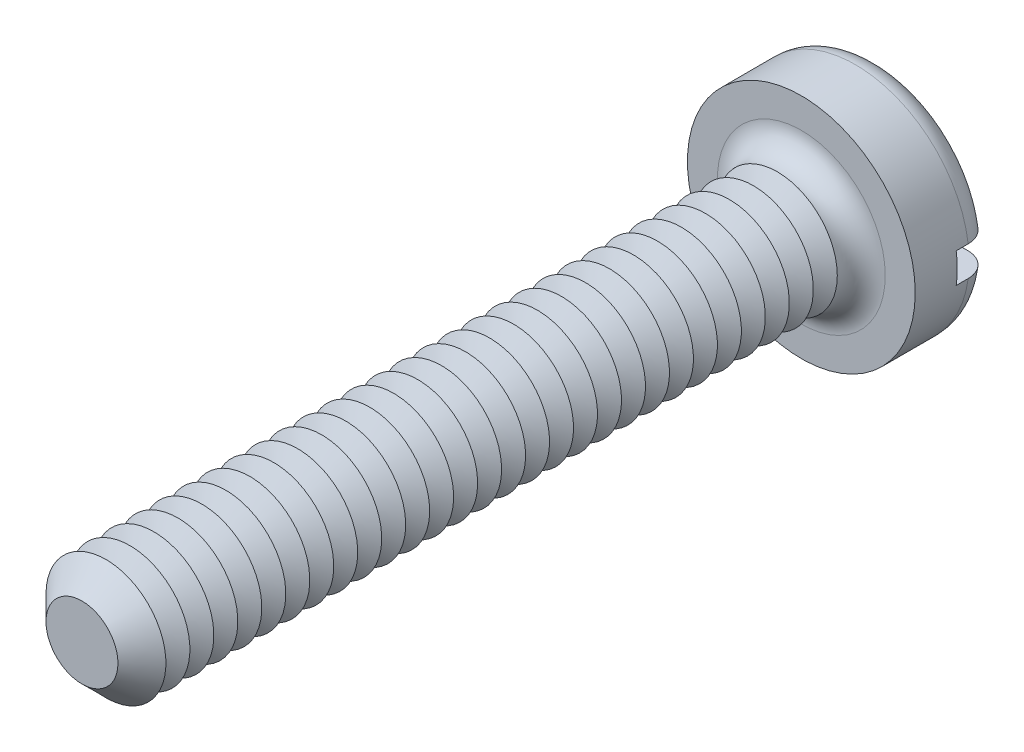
ISO-10303-21;
HEADER;
FILE_DESCRIPTION(('STEP AP214'),'2;1');
FILE_NAME('part.step','',(''),(''),'','','');
FILE_SCHEMA(('AUTOMOTIVE_DESIGN { 1 0 10303 214 1 1 1 1 }'));
ENDSEC;
DATA;
#1=APPLICATION_CONTEXT('core data for automotive mechanical design processes');
#2=APPLICATION_PROTOCOL_DEFINITION('international standard','automotive_design',2000,#1);
#3=PRODUCT_CONTEXT('',#1,'mechanical');
#4=PRODUCT('Part','Part','',(#3));
#5=PRODUCT_RELATED_PRODUCT_CATEGORY('part','',(#4));
#6=PRODUCT_DEFINITION_FORMATION('','',#4);
#7=PRODUCT_DEFINITION_CONTEXT('part definition',#1,'design');
#8=PRODUCT_DEFINITION('design','',#6,#7);
#9=PRODUCT_DEFINITION_SHAPE('','',#8);
#10=(LENGTH_UNIT() NAMED_UNIT(*) SI_UNIT(.MILLI.,.METRE.));
#11=(NAMED_UNIT(*) PLANE_ANGLE_UNIT() SI_UNIT($,.RADIAN.));
#12=(NAMED_UNIT(*) SI_UNIT($,.STERADIAN.) SOLID_ANGLE_UNIT());
#13=UNCERTAINTY_MEASURE_WITH_UNIT(LENGTH_MEASURE(1.E-05),#10,'distance_accuracy_value','');
#14=(GEOMETRIC_REPRESENTATION_CONTEXT(3) GLOBAL_UNCERTAINTY_ASSIGNED_CONTEXT((#13)) GLOBAL_UNIT_ASSIGNED_CONTEXT((#10,
#11,#12)) REPRESENTATION_CONTEXT('',''));
#15=CARTESIAN_POINT('',(0.,0.,0.));
#16=DIRECTION('',(0.,0.,1.));
#17=DIRECTION('',(1.,0.,0.));
#18=AXIS2_PLACEMENT_3D('',#15,#16,#17);
#19=CARTESIAN_POINT('',(0.,0.,-1.3));
#20=DIRECTION('',(0.,0.,1.));
#21=DIRECTION('',(1.,0.,0.));
#22=AXIS2_PLACEMENT_3D('',#19,#20,#21);
#23=PLANE('',#22);
#24=CARTESIAN_POINT('',(0.,0.,-1.3));
#25=DIRECTION('',(0.,0.,1.));
#26=DIRECTION('',(1.,0.,0.));
#27=AXIS2_PLACEMENT_3D('',#24,#25,#26);
#28=CIRCLE('',#27,1.5);
#29=CARTESIAN_POINT('',(-1.4790199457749,0.25,-1.3));
#30=VERTEX_POINT('',#29);
#31=CARTESIAN_POINT('',(1.4790199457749,0.25,-1.3));
#32=VERTEX_POINT('',#31);
#33=EDGE_CURVE('E116',#30,#32,#28,.F.);
#34=ORIENTED_EDGE('',*,*,#33,.T.);
#35=DIRECTION('',(1.,0.,0.));
#36=VECTOR('',#35,1.);
#37=CARTESIAN_POINT('',(-1.9,0.25,-1.3));
#38=LINE('',#37,#36);
#39=EDGE_CURVE('E111',#30,#32,#38,.T.);
#40=ORIENTED_EDGE('',*,*,#39,.F.);
#41=EDGE_LOOP('',(#34,#40));
#42=FACE_BOUND('',#41,.T.);
#43=ADVANCED_FACE('F39',(#42),#23,.F.);
#44=CARTESIAN_POINT('',(0.,0.,-0.9));
#45=DIRECTION('',(0.,0.,1.));
#46=DIRECTION('',(1.,0.,0.));
#47=AXIS2_PLACEMENT_3D('',#44,#45,#46);
#48=TOROIDAL_SURFACE('',#47,1.5,0.4);
#49=CARTESIAN_POINT('',(-1.8150392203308,0.25,-1.12284384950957));
#50=CARTESIAN_POINT('',(-1.80236980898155,0.25,-1.14155059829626));
#51=CARTESIAN_POINT('',(-1.78809920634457,0.25,-1.15919399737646));
#52=CARTESIAN_POINT('',(-1.75677844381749,0.25,-1.19184073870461));
#53=CARTESIAN_POINT('',(-1.73972468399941,0.25,-1.20684060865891));
#54=CARTESIAN_POINT('',(-1.70336024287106,0.25,-1.23375848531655));
#55=CARTESIAN_POINT('',(-1.68405164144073,0.25,-1.24567930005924));
#56=CARTESIAN_POINT('',(-1.64372549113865,0.25,-1.26613528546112));
#57=CARTESIAN_POINT('',(-1.6227083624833,0.25,-1.27467128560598));
#58=CARTESIAN_POINT('',(-1.57937988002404,0.25,-1.2881995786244));
#59=CARTESIAN_POINT('',(-1.55705957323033,0.25,-1.29316318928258));
#60=CARTESIAN_POINT('',(-1.51190394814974,0.25,-1.29931753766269));
#61=CARTESIAN_POINT('',(-1.48906857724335,0.25,-1.3005078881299));
#62=CARTESIAN_POINT('',(-1.4432641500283,0.25,-1.29909058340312));
#63=CARTESIAN_POINT('',(-1.42029638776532,0.25,-1.29644099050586));
#64=CARTESIAN_POINT('',(-1.37512297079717,0.25,-1.28735146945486));
#65=CARTESIAN_POINT('',(-1.3529173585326,0.25,-1.28091133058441));
#66=CARTESIAN_POINT('',(-1.30974098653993,0.25,-1.26436295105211));
#67=CARTESIAN_POINT('',(-1.28877978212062,0.25,-1.25422975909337));
#68=CARTESIAN_POINT('',(-1.24886205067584,0.25,-1.23057736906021));
#69=CARTESIAN_POINT('',(-1.22990554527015,0.25,-1.21705813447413));
#70=CARTESIAN_POINT('',(-1.19461911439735,0.25,-1.18704970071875));
#71=CARTESIAN_POINT('',(-1.17828051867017,0.25,-1.17057070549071));
#72=CARTESIAN_POINT('',(-1.14865897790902,0.25,-1.13506201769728));
#73=CARTESIAN_POINT('',(-1.13537576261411,0.25,-1.11603255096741));
#74=CARTESIAN_POINT('',(-1.11249827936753,0.25,-1.07630328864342));
#75=CARTESIAN_POINT('',(-1.10284494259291,0.25,-1.05563752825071));
#76=CARTESIAN_POINT('',(-1.08724024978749,0.25,-1.01295282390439));
#77=CARTESIAN_POINT('',(-1.08128829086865,0.25,-0.990934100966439));
#78=CARTESIAN_POINT('',(-1.07339124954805,0.25,-0.946722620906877));
#79=CARTESIAN_POINT('',(-1.07135558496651,0.25,-0.924546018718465));
#80=CARTESIAN_POINT('',(-1.07108722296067,0.25,-0.880170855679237));
#81=CARTESIAN_POINT('',(-1.07285419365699,0.25,-0.857972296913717));
#82=CARTESIAN_POINT('',(-1.0800838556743,0.25,-0.814463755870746));
#83=CARTESIAN_POINT('',(-1.08550159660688,0.25,-0.793146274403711));
#84=CARTESIAN_POINT('',(-1.09980522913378,0.25,-0.751709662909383));
#85=CARTESIAN_POINT('',(-1.10869126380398,0.25,-0.731590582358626));
#86=CARTESIAN_POINT('',(-1.12975121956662,0.25,-0.692901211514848));
#87=CARTESIAN_POINT('',(-1.14195627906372,0.25,-0.674347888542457));
#88=CARTESIAN_POINT('',(-1.1692428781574,0.25,-0.639494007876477));
#89=CARTESIAN_POINT('',(-1.18432473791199,0.25,-0.623193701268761));
#90=CARTESIAN_POINT('',(-1.21730350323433,0.25,-0.592916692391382));
#91=CARTESIAN_POINT('',(-1.23525650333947,0.25,-0.579001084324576));
#92=CARTESIAN_POINT('',(-1.27320799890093,0.25,-0.554314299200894));
#93=CARTESIAN_POINT('',(-1.2932067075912,0.25,-0.543543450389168));
#94=CARTESIAN_POINT('',(-1.33509120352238,0.25,-0.525253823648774));
#95=CARTESIAN_POINT('',(-1.35700545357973,0.25,-0.517800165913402));
#96=CARTESIAN_POINT('',(-1.401770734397,0.25,-0.506652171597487));
#97=CARTESIAN_POINT('',(-1.42462180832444,0.25,-0.502958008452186));
#98=CARTESIAN_POINT('',(-1.4707602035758,0.25,-0.499429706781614));
#99=CARTESIAN_POINT('',(-1.49404932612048,0.25,-0.499619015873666));
#100=CARTESIAN_POINT('',(-1.54026206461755,0.25,-0.50392615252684));
#101=CARTESIAN_POINT('',(-1.56318568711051,0.25,-0.508043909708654));
#102=CARTESIAN_POINT('',(-1.60788420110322,0.25,-0.520077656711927));
#103=CARTESIAN_POINT('',(-1.6296645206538,0.25,-0.527973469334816));
#104=CARTESIAN_POINT('',(-1.67156889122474,0.25,-0.547348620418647));
#105=CARTESIAN_POINT('',(-1.69169302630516,0.25,-0.558827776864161));
#106=CARTESIAN_POINT('',(-1.72948251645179,0.25,-0.584913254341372));
#107=CARTESIAN_POINT('',(-1.74717189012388,0.25,-0.599484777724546));
#108=CARTESIAN_POINT('',(-1.77981909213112,0.25,-0.63142070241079));
#109=CARTESIAN_POINT('',(-1.79477707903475,0.25,-0.648784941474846));
#110=CARTESIAN_POINT('',(-1.82136524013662,0.25,-0.685607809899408));
#111=CARTESIAN_POINT('',(-1.83303003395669,0.25,-0.705041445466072));
#112=CARTESIAN_POINT('',(-1.85289960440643,0.25,-0.745602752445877));
#113=CARTESIAN_POINT('',(-1.86110468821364,0.25,-0.76673027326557));
#114=CARTESIAN_POINT('',(-1.87375648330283,0.25,-0.809891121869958));
#115=CARTESIAN_POINT('',(-1.87823381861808,0.25,-0.831915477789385));
#116=CARTESIAN_POINT('',(-1.88341152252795,0.25,-0.87640983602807));
#117=CARTESIAN_POINT('',(-1.88411103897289,0.25,-0.898879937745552));
#118=CARTESIAN_POINT('',(-1.88171559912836,0.25,-0.943534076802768));
#119=CARTESIAN_POINT('',(-1.87863413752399,0.25,-0.965718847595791));
#120=CARTESIAN_POINT('',(-1.86879153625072,0.25,-1.00923650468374));
#121=CARTESIAN_POINT('',(-1.86203494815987,0.25,-1.03057040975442));
#122=CARTESIAN_POINT('',(-1.84837477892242,0.25,-1.06373797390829));
#123=CARTESIAN_POINT('',(-1.84255723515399,0.25,-1.07603047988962));
#124=CARTESIAN_POINT('',(-1.82969924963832,0.25,-1.09995814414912));
#125=CARTESIAN_POINT('',(-1.82265881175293,0.25,-1.11159330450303));
#126=CARTESIAN_POINT('',(-1.8150392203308,0.25,-1.12284384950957));
#127=B_SPLINE_CURVE_WITH_KNOTS('',3,(#49,#50,#51,#52,#53,#54,#55,#56,#57,#58,#59,#60,#61,#62,
#63,#64,#65,#66,#67,#68,#69,#70,#71,#72,#73,#74,#75,#76,#77,#78,#79,#80,#81,#82,#83,#84,#85,#86,
#87,#88,#89,#90,#91,#92,#93,#94,#95,#96,#97,#98,#99,#100,#101,#102,#103,#104,#105,#106,#107,
#108,#109,#110,#111,#112,#113,#114,#115,#116,#117,#118,#119,#120,#121,#122,#123,#124,#125,#126),
.UNSPECIFIED.,.T.,.F.,(4,2,2,2,2,2,2,2,2,2,2,2,2,2,2,2,2,2,2,2,2,2,2,2,2,2,2,2,2,2,2,2,2,2,2,2,
2,2,4),(0.,0.0677296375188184,0.135547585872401,0.203303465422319,0.27104273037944,
0.339319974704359,0.407604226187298,0.47663988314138,0.545679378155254,0.615194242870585,
0.684709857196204,0.753990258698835,0.82326452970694,0.891356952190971,0.959438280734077,
1.02592503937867,1.0924059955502,1.15808300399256,1.2237627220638,1.29008126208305,
1.35640718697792,1.4242376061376,1.49207510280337,1.5611911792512,1.63031044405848,
1.69984715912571,1.76938262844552,1.8385508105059,1.90771547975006,1.97613962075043,
2.04455978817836,2.11223135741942,2.17989691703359,2.24700094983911,2.31412011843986,
2.38100042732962,2.44779809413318,2.48853193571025,2.52926564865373),.UNSPECIFIED.);
#128=CARTESIAN_POINT('',(-1.88348082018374,0.25,-0.9));
#129=VERTEX_POINT('',#128);
#130=EDGE_CURVE('E402',#129,#30,#127,.T.);
#131=ORIENTED_EDGE('',*,*,#130,.F.);
#132=CARTESIAN_POINT('',(0.,0.,-0.9));
#133=DIRECTION('',(0.,0.,1.));
#134=DIRECTION('',(1.,0.,0.));
#135=AXIS2_PLACEMENT_3D('',#132,#133,#134);
#136=CIRCLE('',#135,1.9);
#137=CARTESIAN_POINT('',(1.88348082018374,0.25,-0.9));
#138=VERTEX_POINT('',#137);
#139=EDGE_CURVE('E125',#138,#129,#136,.T.);
#140=ORIENTED_EDGE('',*,*,#139,.F.);
#141=CARTESIAN_POINT('',(1.11362660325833,0.25,-1.07710243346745));
#142=CARTESIAN_POINT('',(1.12388366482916,0.25,-1.09736755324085));
#143=CARTESIAN_POINT('',(1.13589127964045,0.25,-1.11676768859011));
#144=CARTESIAN_POINT('',(1.16301945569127,0.25,-1.15328107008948));
#145=CARTESIAN_POINT('',(1.17814463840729,0.25,-1.17039085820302));
#146=CARTESIAN_POINT('',(1.21101661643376,0.25,-1.20182395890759));
#147=CARTESIAN_POINT('',(1.22875976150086,0.25,-1.21615108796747));
#148=CARTESIAN_POINT('',(1.26636392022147,0.25,-1.24166932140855));
#149=CARTESIAN_POINT('',(1.28622436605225,0.25,-1.25286126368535));
#150=CARTESIAN_POINT('',(1.32781377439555,0.25,-1.27196191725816));
#151=CARTESIAN_POINT('',(1.34956550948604,0.25,-1.27982107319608));
#152=CARTESIAN_POINT('',(1.39407620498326,0.25,-1.29180513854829));
#153=CARTESIAN_POINT('',(1.41683526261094,0.25,-1.29592968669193));
#154=CARTESIAN_POINT('',(1.46288034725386,0.25,-1.3003367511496));
#155=CARTESIAN_POINT('',(1.48616890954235,0.25,-1.30059287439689));
#156=CARTESIAN_POINT('',(1.53245605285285,0.25,-1.29717239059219));
#157=CARTESIAN_POINT('',(1.55545463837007,0.25,-1.29349584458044));
#158=CARTESIAN_POINT('',(1.60038828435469,0.25,-1.28232271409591));
#159=CARTESIAN_POINT('',(1.62232790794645,0.25,-1.27484449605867));
#160=CARTESIAN_POINT('',(1.66461970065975,0.25,-1.25627203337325));
#161=CARTESIAN_POINT('',(1.68497195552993,0.25,-1.24517798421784));
#162=CARTESIAN_POINT('',(1.72328060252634,0.25,-1.21981269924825));
#163=CARTESIAN_POINT('',(1.74126001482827,0.25,-1.2055762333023));
#164=CARTESIAN_POINT('',(1.77453973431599,0.25,-1.17425606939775));
#165=CARTESIAN_POINT('',(1.78984019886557,0.25,-1.1571725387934));
#166=CARTESIAN_POINT('',(1.81715014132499,0.25,-1.12084732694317));
#167=CARTESIAN_POINT('',(1.82919410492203,0.25,-1.10163156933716));
#168=CARTESIAN_POINT('',(1.84985315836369,0.25,-1.06143759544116));
#169=CARTESIAN_POINT('',(1.85846842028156,0.25,-1.04045946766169));
#170=CARTESIAN_POINT('',(1.87195437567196,0.25,-0.997526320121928));
#171=CARTESIAN_POINT('',(1.87685590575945,0.25,-0.975580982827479));
#172=CARTESIAN_POINT('',(1.88288741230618,0.25,-0.931178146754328));
#173=CARTESIAN_POINT('',(1.88401750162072,0.25,-0.908720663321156));
#174=CARTESIAN_POINT('',(1.88247598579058,0.25,-0.864033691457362));
#175=CARTESIAN_POINT('',(1.87982069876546,0.25,-0.841803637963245));
#176=CARTESIAN_POINT('',(1.87081646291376,0.25,-0.798104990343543));
#177=CARTESIAN_POINT('',(1.86446754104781,0.25,-0.776636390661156));
#178=CARTESIAN_POINT('',(1.84826063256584,0.25,-0.735060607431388));
#179=CARTESIAN_POINT('',(1.83840161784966,0.25,-0.714953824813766));
#180=CARTESIAN_POINT('',(1.81546327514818,0.25,-0.676670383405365));
#181=CARTESIAN_POINT('',(1.80238389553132,0.25,-0.658493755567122));
#182=CARTESIAN_POINT('',(1.77331327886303,0.25,-0.62448916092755));
#183=CARTESIAN_POINT('',(1.75730833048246,0.25,-0.608672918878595));
#184=CARTESIAN_POINT('',(1.72289038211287,0.25,-0.579924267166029));
#185=CARTESIAN_POINT('',(1.70447729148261,0.25,-0.566991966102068));
#186=CARTESIAN_POINT('',(1.66559643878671,0.25,-0.544254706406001));
#187=CARTESIAN_POINT('',(1.64511218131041,0.25,-0.53447796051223));
#188=CARTESIAN_POINT('',(1.60280554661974,0.25,-0.518459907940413));
#189=CARTESIAN_POINT('',(1.58098309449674,0.25,-0.512218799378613));
#190=CARTESIAN_POINT('',(1.53636184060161,0.25,-0.503375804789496));
#191=CARTESIAN_POINT('',(1.51355490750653,0.25,-0.500814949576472));
#192=CARTESIAN_POINT('',(1.46783245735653,0.25,-0.499516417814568));
#193=CARTESIAN_POINT('',(1.44491693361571,0.25,-0.500778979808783));
#194=CARTESIAN_POINT('',(1.39937748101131,0.25,-0.50711284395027));
#195=CARTESIAN_POINT('',(1.37675897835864,0.25,-0.512223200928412));
#196=CARTESIAN_POINT('',(1.33269286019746,0.25,-0.526151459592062));
#197=CARTESIAN_POINT('',(1.31124530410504,0.25,-0.534969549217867));
#198=CARTESIAN_POINT('',(1.27004097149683,0.25,-0.556118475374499));
#199=CARTESIAN_POINT('',(1.25029179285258,0.25,-0.568464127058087));
#200=CARTESIAN_POINT('',(1.21316554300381,0.25,-0.59631968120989));
#201=CARTESIAN_POINT('',(1.19578844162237,0.25,-0.611829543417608));
#202=CARTESIAN_POINT('',(1.16406059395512,0.25,-0.645459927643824));
#203=CARTESIAN_POINT('',(1.14968747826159,0.25,-0.663559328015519));
#204=CARTESIAN_POINT('',(1.12425968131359,0.25,-0.70195566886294));
#205=CARTESIAN_POINT('',(1.11320445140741,0.25,-0.722252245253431));
#206=CARTESIAN_POINT('',(1.09497726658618,0.25,-0.764020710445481));
#207=CARTESIAN_POINT('',(1.08772970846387,0.25,-0.785459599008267));
#208=CARTESIAN_POINT('',(1.07702618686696,0.25,-0.829269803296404));
#209=CARTESIAN_POINT('',(1.07357062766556,0.25,-0.851641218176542));
#210=CARTESIAN_POINT('',(1.07060826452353,0.25,-0.896160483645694));
#211=CARTESIAN_POINT('',(1.07101876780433,0.25,-0.918302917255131));
#212=CARTESIAN_POINT('',(1.07557730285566,0.25,-0.962179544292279));
#213=CARTESIAN_POINT('',(1.07972048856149,0.25,-0.983914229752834));
#214=CARTESIAN_POINT('',(1.08912066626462,0.25,-1.01754924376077));
#215=CARTESIAN_POINT('',(1.09320341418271,0.25,-1.02979035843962));
#216=CARTESIAN_POINT('',(1.10254493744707,0.25,-1.05381470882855));
#217=CARTESIAN_POINT('',(1.10780368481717,0.25,-1.06559795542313));
#218=CARTESIAN_POINT('',(1.11362660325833,0.25,-1.07710243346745));
#219=B_SPLINE_CURVE_WITH_KNOTS('',3,(#141,#142,#143,#144,#145,#146,#147,#148,#149,#150,#151,
#152,#153,#154,#155,#156,#157,#158,#159,#160,#161,#162,#163,#164,#165,#166,#167,#168,#169,#170,
#171,#172,#173,#174,#175,#176,#177,#178,#179,#180,#181,#182,#183,#184,#185,#186,#187,#188,#189,
#190,#191,#192,#193,#194,#195,#196,#197,#198,#199,#200,#201,#202,#203,#204,#205,#206,#207,#208,
#209,#210,#211,#212,#213,#214,#215,#216,#217,#218),.UNSPECIFIED.,.T.,.F.,(4,2,2,2,2,2,2,2,2,2,2,
2,2,2,2,2,2,2,2,2,2,2,2,2,2,2,2,2,2,2,2,2,2,2,2,2,2,2,4),(0.,0.0680907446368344,
0.136283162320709,0.204381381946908,0.272461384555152,0.341520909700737,0.410587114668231,
0.480124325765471,0.549660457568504,0.618863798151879,0.688063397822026,0.756532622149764,
0.824997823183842,0.892706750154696,0.960412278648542,1.02754926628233,1.09468424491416,
1.16153068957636,1.22837664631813,1.29524219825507,1.36210882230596,1.42929726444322,
1.49648823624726,1.56426429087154,1.63204414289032,1.70057395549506,1.76910804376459,
1.83834728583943,1.90759003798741,1.97712798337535,2.0466650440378,2.11566422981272,
2.18465199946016,2.25221259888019,2.3197804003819,2.38590630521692,2.45194648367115,
2.49060241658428,2.5292574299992),.UNSPECIFIED.);
#220=EDGE_CURVE('E404',#32,#138,#219,.T.);
#221=ORIENTED_EDGE('',*,*,#220,.F.);
#222=ORIENTED_EDGE('',*,*,#33,.F.);
#223=EDGE_LOOP('',(#131,#140,#221,#222));
#224=FACE_BOUND('',#223,.T.);
#225=ADVANCED_FACE('F386',(#224),#48,.T.);
#226=CARTESIAN_POINT('',(0.,0.,-1.3));
#227=DIRECTION('',(0.,0.,1.));
#228=DIRECTION('',(1.,0.,0.));
#229=AXIS2_PLACEMENT_3D('',#226,#227,#228);
#230=CYLINDRICAL_SURFACE('',#229,1.9);
#231=DIRECTION('',(0.,0.,1.));
#232=VECTOR('',#231,1.);
#233=CARTESIAN_POINT('',(1.88348082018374,0.25,-1.3));
#234=LINE('',#233,#232);
#235=CARTESIAN_POINT('',(1.88348082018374,0.25,-0.7));
#236=VERTEX_POINT('',#235);
#237=EDGE_CURVE('E418',#138,#236,#234,.T.);
#238=ORIENTED_EDGE('',*,*,#237,.F.);
#239=ORIENTED_EDGE('',*,*,#139,.T.);
#240=DIRECTION('',(0.,0.,1.));
#241=VECTOR('',#240,1.);
#242=CARTESIAN_POINT('',(-1.88348082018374,0.25,-1.3));
#243=LINE('',#242,#241);
#244=CARTESIAN_POINT('',(-1.88348082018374,0.25,-0.7));
#245=VERTEX_POINT('',#244);
#246=EDGE_CURVE('E63',#245,#129,#243,.F.);
#247=ORIENTED_EDGE('',*,*,#246,.F.);
#248=CARTESIAN_POINT('',(0.,0.,-0.7));
#249=DIRECTION('',(0.,0.,-1.));
#250=DIRECTION('',(-1.,0.,0.));
#251=AXIS2_PLACEMENT_3D('',#248,#249,#250);
#252=CIRCLE('',#251,1.9);
#253=CARTESIAN_POINT('',(-1.88348082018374,-0.25,-0.7));
#254=VERTEX_POINT('',#253);
#255=EDGE_CURVE('E43',#245,#254,#252,.F.);
#256=ORIENTED_EDGE('',*,*,#255,.T.);
#257=DIRECTION('',(0.,0.,1.));
#258=VECTOR('',#257,1.);
#259=CARTESIAN_POINT('',(-1.88348082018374,-0.25,-1.3));
#260=LINE('',#259,#258);
#261=CARTESIAN_POINT('',(-1.88348082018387,-0.25,-0.899999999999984));
#262=VERTEX_POINT('',#261);
#263=EDGE_CURVE('E416',#262,#254,#260,.T.);
#264=ORIENTED_EDGE('',*,*,#263,.F.);
#265=CARTESIAN_POINT('',(1.88348082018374,-0.25,-0.9));
#266=VERTEX_POINT('',#265);
#267=EDGE_CURVE('E127',#262,#266,#136,.T.);
#268=ORIENTED_EDGE('',*,*,#267,.T.);
#269=DIRECTION('',(0.,0.,1.));
#270=VECTOR('',#269,1.);
#271=CARTESIAN_POINT('',(1.88348082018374,-0.25,-1.3));
#272=LINE('',#271,#270);
#273=CARTESIAN_POINT('',(1.88348082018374,-0.25,-0.7));
#274=VERTEX_POINT('',#273);
#275=EDGE_CURVE('E55',#274,#266,#272,.F.);
#276=ORIENTED_EDGE('',*,*,#275,.F.);
#277=EDGE_CURVE('E11',#274,#236,#252,.F.);
#278=ORIENTED_EDGE('',*,*,#277,.T.);
#279=EDGE_LOOP('',(#238,#239,#247,#256,#264,#268,#276,#278));
#280=FACE_BOUND('',#279,.T.);
#281=CARTESIAN_POINT('',(0.,0.,0.));
#282=DIRECTION('',(0.,0.,1.));
#283=DIRECTION('',(1.,0.,0.));
#284=AXIS2_PLACEMENT_3D('',#281,#282,#283);
#285=CIRCLE('',#284,1.9);
#286=CARTESIAN_POINT('',(1.9,0.,0.));
#287=VERTEX_POINT('',#286);
#288=EDGE_CURVE('E421',#287,#287,#285,.T.);
#289=ORIENTED_EDGE('',*,*,#288,.F.);
#290=EDGE_LOOP('',(#289));
#291=FACE_BOUND('',#290,.T.);
#292=ADVANCED_FACE('F382',(#280,#291),#230,.T.);
#293=CARTESIAN_POINT('',(1.4790199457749,-0.25,-1.3));
#294=VERTEX_POINT('',#293);
#295=CARTESIAN_POINT('',(-1.4790199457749,-0.25,-1.3));
#296=VERTEX_POINT('',#295);
#297=EDGE_CURVE('E109',#294,#296,#28,.F.);
#298=ORIENTED_EDGE('',*,*,#297,.T.);
#299=DIRECTION('',(-1.,0.,0.));
#300=VECTOR('',#299,1.);
#301=CARTESIAN_POINT('',(-1.9,-0.25,-1.3));
#302=LINE('',#301,#300);
#303=EDGE_CURVE('E96',#294,#296,#302,.T.);
#304=ORIENTED_EDGE('',*,*,#303,.F.);
#305=EDGE_LOOP('',(#298,#304));
#306=FACE_BOUND('',#305,.T.);
#307=ADVANCED_FACE('F108',(#306),#23,.F.);
#308=CARTESIAN_POINT('',(0.,0.,0.));
#309=DIRECTION('',(0.,0.,1.));
#310=DIRECTION('',(1.,0.,0.));
#311=AXIS2_PLACEMENT_3D('',#308,#309,#310);
#312=PLANE('',#311);
#313=CARTESIAN_POINT('',(0.,0.,0.));
#314=DIRECTION('',(0.,0.,1.));
#315=DIRECTION('',(1.,0.,0.));
#316=AXIS2_PLACEMENT_3D('',#313,#314,#315);
#317=CIRCLE('',#316,1.4);
#318=CARTESIAN_POINT('',(1.4,0.,0.));
#319=VERTEX_POINT('',#318);
#320=EDGE_CURVE('E115',#319,#319,#317,.F.);
#321=ORIENTED_EDGE('',*,*,#320,.T.);
#322=EDGE_LOOP('',(#321));
#323=FACE_BOUND('',#322,.T.);
#324=ORIENTED_EDGE('',*,*,#288,.T.);
#325=EDGE_LOOP('',(#324));
#326=FACE_BOUND('',#325,.T.);
#327=ADVANCED_FACE('F381',(#323,#326),#312,.T.);
#328=CARTESIAN_POINT('',(-1.8150392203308,-0.25,-1.12284384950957));
#329=CARTESIAN_POINT('',(-1.82756185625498,-0.25,-1.10435021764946));
#330=CARTESIAN_POINT('',(-1.83853807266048,-0.25,-1.08479072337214));
#331=CARTESIAN_POINT('',(-1.85706233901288,-0.25,-1.04409188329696));
#332=CARTESIAN_POINT('',(-1.86460655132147,-0.25,-1.02295079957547));
#333=CARTESIAN_POINT('',(-1.87603074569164,-0.25,-0.979704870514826));
#334=CARTESIAN_POINT('',(-1.87991177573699,-0.25,-0.957600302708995));
#335=CARTESIAN_POINT('',(-1.88389586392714,-0.25,-0.913058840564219));
#336=CARTESIAN_POINT('',(-1.88399981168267,-0.25,-0.890622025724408));
#337=CARTESIAN_POINT('',(-1.88043374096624,-0.25,-0.846104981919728));
#338=CARTESIAN_POINT('',(-1.87677281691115,-0.25,-0.824024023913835));
#339=CARTESIAN_POINT('',(-1.86579880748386,-0.25,-0.780788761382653));
#340=CARTESIAN_POINT('',(-1.85848560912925,-0.25,-0.759634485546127));
#341=CARTESIAN_POINT('',(-1.8404137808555,-0.25,-0.718830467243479));
#342=CARTESIAN_POINT('',(-1.82965205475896,-0.25,-0.699182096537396));
#343=CARTESIAN_POINT('',(-1.80499939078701,-0.25,-0.661958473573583));
#344=CARTESIAN_POINT('',(-1.7911083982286,-0.25,-0.644383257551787));
#345=CARTESIAN_POINT('',(-1.76051564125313,-0.25,-0.611699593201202));
#346=CARTESIAN_POINT('',(-1.74379913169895,-0.25,-0.596604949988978));
#347=CARTESIAN_POINT('',(-1.70808901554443,-0.25,-0.569406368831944));
#348=CARTESIAN_POINT('',(-1.68909532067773,-0.25,-0.557302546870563));
#349=CARTESIAN_POINT('',(-1.64918615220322,-0.25,-0.536307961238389));
#350=CARTESIAN_POINT('',(-1.62825469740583,-0.25,-0.527447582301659));
#351=CARTESIAN_POINT('',(-1.58521203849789,-0.25,-0.513323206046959));
#352=CARTESIAN_POINT('',(-1.5631007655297,-0.25,-0.508059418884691));
#353=CARTESIAN_POINT('',(-1.51806209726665,-0.25,-0.501215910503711));
#354=CARTESIAN_POINT('',(-1.4951283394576,-0.25,-0.499678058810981));
#355=CARTESIAN_POINT('',(-1.4493239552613,-0.25,-0.500434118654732));
#356=CARTESIAN_POINT('',(-1.4264533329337,-0.25,-0.502728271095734));
#357=CARTESIAN_POINT('',(-1.38118643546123,-0.25,-0.511115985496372));
#358=CARTESIAN_POINT('',(-1.35879703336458,-0.25,-0.51724667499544));
#359=CARTESIAN_POINT('',(-1.31535851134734,-0.25,-0.533167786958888));
#360=CARTESIAN_POINT('',(-1.29430945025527,-0.25,-0.542958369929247));
#361=CARTESIAN_POINT('',(-1.25409242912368,-0.25,-0.565968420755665));
#362=CARTESIAN_POINT('',(-1.23493023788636,-0.25,-0.579197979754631));
#363=CARTESIAN_POINT('',(-1.19912477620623,-0.25,-0.608715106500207));
#364=CARTESIAN_POINT('',(-1.18248143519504,-0.25,-0.625002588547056));
#365=CARTESIAN_POINT('',(-1.15237533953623,-0.25,-0.660018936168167));
#366=CARTESIAN_POINT('',(-1.13888343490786,-0.25,-0.678722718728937));
#367=CARTESIAN_POINT('',(-1.115312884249,-0.25,-0.718170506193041));
#368=CARTESIAN_POINT('',(-1.10523377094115,-0.25,-0.738914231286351));
#369=CARTESIAN_POINT('',(-1.08901310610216,-0.25,-0.781372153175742));
#370=CARTESIAN_POINT('',(-1.08279080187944,-0.25,-0.803055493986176));
#371=CARTESIAN_POINT('',(-1.07416105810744,-0.25,-0.847167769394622));
#372=CARTESIAN_POINT('',(-1.07175306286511,-0.25,-0.869596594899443));
#373=CARTESIAN_POINT('',(-1.07084656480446,-0.25,-0.914070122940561));
#374=CARTESIAN_POINT('',(-1.07226874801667,-0.25,-0.936113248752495));
#375=CARTESIAN_POINT('',(-1.07880428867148,-0.25,-0.979644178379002));
#376=CARTESIAN_POINT('',(-1.08391755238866,-0.25,-1.00113199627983));
#377=CARTESIAN_POINT('',(-1.09764616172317,-0.25,-1.04290115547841));
#378=CARTESIAN_POINT('',(-1.10625346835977,-0.25,-1.06318514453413));
#379=CARTESIAN_POINT('',(-1.12669365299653,-0.25,-1.10205584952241));
#380=CARTESIAN_POINT('',(-1.13852679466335,-0.25,-1.12064242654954));
#381=CARTESIAN_POINT('',(-1.16529672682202,-0.25,-1.15594801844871));
#382=CARTESIAN_POINT('',(-1.18028464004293,-0.25,-1.17262825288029));
#383=CARTESIAN_POINT('',(-1.21279183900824,-0.25,-1.20330600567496));
#384=CARTESIAN_POINT('',(-1.23031142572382,-0.25,-1.21730320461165));
#385=CARTESIAN_POINT('',(-1.26781695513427,-0.25,-1.24254670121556));
#386=CARTESIAN_POINT('',(-1.28784999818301,-0.25,-1.25372305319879));
#387=CARTESIAN_POINT('',(-1.3294899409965,-0.25,-1.27260611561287));
#388=CARTESIAN_POINT('',(-1.35109697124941,-0.25,-1.28031253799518));
#389=CARTESIAN_POINT('',(-1.39558575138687,-0.25,-1.29212626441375));
#390=CARTESIAN_POINT('',(-1.4184807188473,-0.25,-1.29618386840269));
#391=CARTESIAN_POINT('',(-1.4646266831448,-0.25,-1.30039947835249));
#392=CARTESIAN_POINT('',(-1.48787767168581,-0.25,-1.30055757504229));
#393=CARTESIAN_POINT('',(-1.53407883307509,-0.25,-1.29695468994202));
#394=CARTESIAN_POINT('',(-1.55702895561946,-0.25,-1.29319306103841));
#395=CARTESIAN_POINT('',(-1.60196718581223,-0.25,-1.28183520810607));
#396=CARTESIAN_POINT('',(-1.62395508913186,-0.25,-1.27423817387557));
#397=CARTESIAN_POINT('',(-1.66614393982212,-0.25,-1.25548646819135));
#398=CARTESIAN_POINT('',(-1.68635782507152,-0.25,-1.24436087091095));
#399=CARTESIAN_POINT('',(-1.72458266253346,-0.25,-1.21884344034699));
#400=CARTESIAN_POINT('',(-1.74259637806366,-0.25,-1.20445577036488));
#401=CARTESIAN_POINT('',(-1.76968989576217,-0.25,-1.1787247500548));
#402=CARTESIAN_POINT('',(-1.77959984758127,-0.25,-1.1682407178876));
#403=CARTESIAN_POINT('',(-1.79823423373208,-0.25,-1.14626700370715));
#404=CARTESIAN_POINT('',(-1.80695867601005,-0.25,-1.1347773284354));
#405=CARTESIAN_POINT('',(-1.8150392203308,-0.25,-1.12284384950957));
#406=B_SPLINE_CURVE_WITH_KNOTS('',3,(#328,#329,#330,#331,#332,#333,#334,#335,#336,#337,#338,
#339,#340,#341,#342,#343,#344,#345,#346,#347,#348,#349,#350,#351,#352,#353,#354,#355,#356,#357,
#358,#359,#360,#361,#362,#363,#364,#365,#366,#367,#368,#369,#370,#371,#372,#373,#374,#375,#376,
#377,#378,#379,#380,#381,#382,#383,#384,#385,#386,#387,#388,#389,#390,#391,#392,#393,#394,#395,
#396,#397,#398,#399,#400,#401,#402,#403,#404,#405),.UNSPECIFIED.,.T.,.F.,(4,2,2,2,2,2,2,2,2,2,2,
2,2,2,2,2,2,2,2,2,2,2,2,2,2,2,2,2,2,2,2,2,2,2,2,2,2,2,4),(0.,0.0669512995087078,
0.133977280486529,0.200984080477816,0.267975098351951,0.334804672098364,0.401636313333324,
0.468528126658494,0.535421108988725,0.602674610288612,0.669930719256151,0.737801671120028,
0.805676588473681,0.87431077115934,0.942949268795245,1.0122625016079,1.08157877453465,
1.15110078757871,1.22062085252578,1.28946987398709,1.35830946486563,1.42565417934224,
1.49298908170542,1.55894041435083,1.62489007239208,1.69068884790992,1.75649300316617,
1.82345932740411,1.89043361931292,1.95893391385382,2.02743989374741,2.09686543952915,
2.16628937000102,2.23572476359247,2.3051748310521,2.3740669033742,2.44287154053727,
2.48607383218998,2.52927583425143),.UNSPECIFIED.);
#407=EDGE_CURVE('E103',#296,#262,#406,.T.);
#408=ORIENTED_EDGE('',*,*,#407,.F.);
#409=ORIENTED_EDGE('',*,*,#297,.F.);
#410=CARTESIAN_POINT('',(1.11362660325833,-0.25,-1.07710243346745));
#411=CARTESIAN_POINT('',(1.10368387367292,-0.25,-1.05745397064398));
#412=CARTESIAN_POINT('',(1.09537204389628,-0.25,-1.0369644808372));
#413=CARTESIAN_POINT('',(1.08229212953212,-0.25,-0.994867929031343));
#414=CARTESIAN_POINT('',(1.07752732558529,-0.25,-0.973259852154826));
#415=CARTESIAN_POINT('',(1.07171197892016,-0.25,-0.929545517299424));
#416=CARTESIAN_POINT('',(1.07066166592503,-0.25,-0.907439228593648));
#417=CARTESIAN_POINT('',(1.07231382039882,-0.25,-0.863372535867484));
#418=CARTESIAN_POINT('',(1.07501551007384,-0.25,-0.841412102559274));
#419=CARTESIAN_POINT('',(1.08404966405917,-0.25,-0.798386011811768));
#420=CARTESIAN_POINT('',(1.09036099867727,-0.25,-0.777315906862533));
#421=CARTESIAN_POINT('',(1.10638973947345,-0.25,-0.736514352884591));
#422=CARTESIAN_POINT('',(1.11610743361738,-0.25,-0.716783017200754));
#423=CARTESIAN_POINT('',(1.13878208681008,-0.25,-0.678952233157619));
#424=CARTESIAN_POINT('',(1.15177705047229,-0.25,-0.660875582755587));
#425=CARTESIAN_POINT('',(1.18055347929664,-0.25,-0.62709692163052));
#426=CARTESIAN_POINT('',(1.19633525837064,-0.25,-0.611395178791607));
#427=CARTESIAN_POINT('',(1.23062926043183,-0.25,-0.582430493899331));
#428=CARTESIAN_POINT('',(1.24919608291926,-0.25,-0.569232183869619));
#429=CARTESIAN_POINT('',(1.28825118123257,-0.25,-0.546076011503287));
#430=CARTESIAN_POINT('',(1.30873964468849,-0.25,-0.536118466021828));
#431=CARTESIAN_POINT('',(1.35144534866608,-0.25,-0.519560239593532));
#432=CARTESIAN_POINT('',(1.3736865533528,-0.25,-0.513021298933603));
#433=CARTESIAN_POINT('',(1.41894945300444,-0.25,-0.503751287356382));
#434=CARTESIAN_POINT('',(1.44197117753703,-0.25,-0.50102036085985));
#435=CARTESIAN_POINT('',(1.48824913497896,-0.25,-0.499449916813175));
#436=CARTESIAN_POINT('',(1.5115059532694,-0.25,-0.500627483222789));
#437=CARTESIAN_POINT('',(1.55748678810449,-0.25,-0.506895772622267));
#438=CARTESIAN_POINT('',(1.58021081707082,-0.25,-0.511986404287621));
#439=CARTESIAN_POINT('',(1.6243247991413,-0.25,-0.525910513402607));
#440=CARTESIAN_POINT('',(1.64572225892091,-0.25,-0.534720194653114));
#441=CARTESIAN_POINT('',(1.68671060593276,-0.25,-0.555845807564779));
#442=CARTESIAN_POINT('',(1.70630159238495,-0.25,-0.568161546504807));
#443=CARTESIAN_POINT('',(1.74289060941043,-0.25,-0.595805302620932));
#444=CARTESIAN_POINT('',(1.75991474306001,-0.25,-0.611098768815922));
#445=CARTESIAN_POINT('',(1.79111916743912,-0.25,-0.644354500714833));
#446=CARTESIAN_POINT('',(1.80529962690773,-0.25,-0.662316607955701));
#447=CARTESIAN_POINT('',(1.83025525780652,-0.25,-0.700191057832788));
#448=CARTESIAN_POINT('',(1.84106535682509,-0.25,-0.720080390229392));
#449=CARTESIAN_POINT('',(1.8591630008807,-0.25,-0.761401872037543));
#450=CARTESIAN_POINT('',(1.86645070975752,-0.25,-0.782833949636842));
#451=CARTESIAN_POINT('',(1.87724305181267,-0.25,-0.826454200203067));
#452=CARTESIAN_POINT('',(1.88077646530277,-0.25,-0.848635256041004));
#453=CARTESIAN_POINT('',(1.88405487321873,-0.25,-0.89327539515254));
#454=CARTESIAN_POINT('',(1.88379996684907,-0.25,-0.915734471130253));
#455=CARTESIAN_POINT('',(1.87951702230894,-0.25,-0.96021054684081));
#456=CARTESIAN_POINT('',(1.87550211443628,-0.25,-0.982228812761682));
#457=CARTESIAN_POINT('',(1.86383665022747,-0.25,-1.0252797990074));
#458=CARTESIAN_POINT('',(1.85618610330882,-0.25,-1.04631252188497));
#459=CARTESIAN_POINT('',(1.83746332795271,-0.25,-1.08682395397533));
#460=CARTESIAN_POINT('',(1.82638722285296,-0.25,-1.10630087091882));
#461=CARTESIAN_POINT('',(1.80113946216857,-0.25,-1.14313202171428));
#462=CARTESIAN_POINT('',(1.78696774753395,-0.25,-1.1604862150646));
#463=CARTESIAN_POINT('',(1.75585044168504,-0.25,-1.19268694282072));
#464=CARTESIAN_POINT('',(1.73888979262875,-0.25,-1.20751892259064));
#465=CARTESIAN_POINT('',(1.7027387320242,-0.25,-1.23415579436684));
#466=CARTESIAN_POINT('',(1.68354822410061,-0.25,-1.24596055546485));
#467=CARTESIAN_POINT('',(1.64329341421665,-0.25,-1.26632784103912));
#468=CARTESIAN_POINT('',(1.62221336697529,-0.25,-1.27485924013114));
#469=CARTESIAN_POINT('',(1.5789301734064,-0.25,-1.28830571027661));
#470=CARTESIAN_POINT('',(1.55672695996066,-0.25,-1.29322056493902));
#471=CARTESIAN_POINT('',(1.5115614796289,-0.25,-1.29935191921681));
#472=CARTESIAN_POINT('',(1.4885934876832,-0.25,-1.30052625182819));
#473=CARTESIAN_POINT('',(1.44278240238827,-0.25,-1.2990417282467));
#474=CARTESIAN_POINT('',(1.41993931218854,-0.25,-1.29638277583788));
#475=CARTESIAN_POINT('',(1.37479511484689,-0.25,-1.28727159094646));
#476=CARTESIAN_POINT('',(1.35250125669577,-0.25,-1.2807834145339));
#477=CARTESIAN_POINT('',(1.30930729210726,-0.25,-1.2641644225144));
#478=CARTESIAN_POINT('',(1.2884075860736,-0.25,-1.25403256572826));
#479=CARTESIAN_POINT('',(1.24854853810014,-0.25,-1.23036781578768));
#480=CARTESIAN_POINT('',(1.22959511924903,-0.25,-1.21682495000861));
#481=CARTESIAN_POINT('',(1.19427766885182,-0.25,-1.18672803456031));
#482=CARTESIAN_POINT('',(1.17791048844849,-0.25,-1.170177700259));
#483=CARTESIAN_POINT('',(1.15346856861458,-0.25,-1.14079355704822));
#484=CARTESIAN_POINT('',(1.14449891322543,-0.25,-1.12869247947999));
#485=CARTESIAN_POINT('',(1.12797460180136,-0.25,-1.10355927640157));
#486=CARTESIAN_POINT('',(1.1204199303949,-0.25,-1.09052716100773));
#487=CARTESIAN_POINT('',(1.11362660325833,-0.25,-1.07710243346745));
#488=B_SPLINE_CURVE_WITH_KNOTS('',3,(#410,#411,#412,#413,#414,#415,#416,#417,#418,#419,#420,
#421,#422,#423,#424,#425,#426,#427,#428,#429,#430,#431,#432,#433,#434,#435,#436,#437,#438,#439,
#440,#441,#442,#443,#444,#445,#446,#447,#448,#449,#450,#451,#452,#453,#454,#455,#456,#457,#458,
#459,#460,#461,#462,#463,#464,#465,#466,#467,#468,#469,#470,#471,#472,#473,#474,#475,#476,#477,
#478,#479,#480,#481,#482,#483,#484,#485,#486,#487),.UNSPECIFIED.,.T.,.F.,(4,2,2,2,2,2,2,2,2,2,2,
2,2,2,2,2,2,2,2,2,2,2,2,2,2,2,2,2,2,2,2,2,2,2,2,2,2,2,4),(0.,0.0660089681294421,
0.132078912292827,0.198152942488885,0.26421327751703,0.329890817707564,0.395573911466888,
0.462056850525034,0.528547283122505,0.596571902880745,0.664603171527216,0.733823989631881,
0.803047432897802,0.872573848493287,0.94209864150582,1.01118516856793,1.08026789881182,
1.14859228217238,1.21691261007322,1.28449938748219,1.35208302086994,1.41914473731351,
1.48620469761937,1.55303134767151,1.61985782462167,1.68676020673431,1.75366386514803,
1.82094137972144,1.88822180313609,1.95612699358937,2.0240362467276,2.09270838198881,
2.16138224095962,2.23071121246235,2.30006001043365,2.36961396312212,2.4390825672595,
2.48418340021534,2.52928374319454),.UNSPECIFIED.);
#489=EDGE_CURVE('E92',#266,#294,#488,.T.);
#490=ORIENTED_EDGE('',*,*,#489,.F.);
#491=ORIENTED_EDGE('',*,*,#267,.F.);
#492=EDGE_LOOP('',(#408,#409,#490,#491));
#493=FACE_BOUND('',#492,.T.);
#494=ADVANCED_FACE('F113',(#493),#48,.T.);
#495=CARTESIAN_POINT('',(0.,0.,0.399999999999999));
#496=DIRECTION('',(0.,0.,1.));
#497=DIRECTION('',(1.,0.,0.));
#498=AXIS2_PLACEMENT_3D('',#495,#496,#497);
#499=TOROIDAL_SURFACE('',#498,1.4,0.4);
#500=ORIENTED_EDGE('',*,*,#320,.F.);
#501=EDGE_LOOP('',(#500));
#502=FACE_BOUND('',#501,.T.);
#503=CARTESIAN_POINT('',(0.,0.,0.399999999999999));
#504=DIRECTION('',(0.,0.,-1.));
#505=DIRECTION('',(-1.,0.,0.));
#506=AXIS2_PLACEMENT_3D('',#503,#504,#505);
#507=CIRCLE('',#506,1.);
#508=CARTESIAN_POINT('',(-1.,0.,0.399999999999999));
#509=VERTEX_POINT('',#508);
#510=EDGE_CURVE('E427',#509,#509,#507,.T.);
#511=ORIENTED_EDGE('',*,*,#510,.T.);
#512=EDGE_LOOP('',(#511));
#513=FACE_BOUND('',#512,.T.);
#514=ADVANCED_FACE('F374',(#502,#513),#499,.F.);
#515=CARTESIAN_POINT('',(0.,0.,0.599999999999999));
#516=DIRECTION('',(0.,0.,-1.));
#517=DIRECTION('',(-1.,0.,0.));
#518=AXIS2_PLACEMENT_3D('',#515,#516,#517);
#519=CONICAL_SURFACE('',#518,0.653589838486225,1.0471975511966);
#520=ORIENTED_EDGE('',*,*,#510,.F.);
#521=EDGE_LOOP('',(#520));
#522=FACE_BOUND('',#521,.T.);
#523=CARTESIAN_POINT('',(0.,0.,0.599999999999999));
#524=DIRECTION('',(0.,0.,-1.));
#525=DIRECTION('',(-1.,0.,0.));
#526=AXIS2_PLACEMENT_3D('',#523,#524,#525);
#527=CIRCLE('',#526,0.653589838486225);
#528=CARTESIAN_POINT('',(-0.653589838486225,0.,0.599999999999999));
#529=VERTEX_POINT('',#528);
#530=EDGE_CURVE('E433',#529,#529,#527,.T.);
#531=ORIENTED_EDGE('',*,*,#530,.T.);
#532=EDGE_LOOP('',(#531));
#533=FACE_BOUND('',#532,.T.);
#534=ADVANCED_FACE('F370',(#522,#533),#519,.T.);
#535=CARTESIAN_POINT('',(0.,0.,0.799999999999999));
#536=DIRECTION('',(0.,0.,1.));
#537=DIRECTION('',(1.,0.,0.));
#538=AXIS2_PLACEMENT_3D('',#535,#536,#537);
#539=CONICAL_SURFACE('',#538,1.,1.0471975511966);
#540=ORIENTED_EDGE('',*,*,#530,.F.);
#541=EDGE_LOOP('',(#540));
#542=FACE_BOUND('',#541,.T.);
#543=CARTESIAN_POINT('',(0.,0.,0.799999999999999));
#544=DIRECTION('',(0.,0.,-1.));
#545=DIRECTION('',(-1.,0.,0.));
#546=AXIS2_PLACEMENT_3D('',#543,#544,#545);
#547=CIRCLE('',#546,1.);
#548=CARTESIAN_POINT('',(-1.,0.,0.799999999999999));
#549=VERTEX_POINT('',#548);
#550=EDGE_CURVE('E438',#549,#549,#547,.T.);
#551=ORIENTED_EDGE('',*,*,#550,.T.);
#552=EDGE_LOOP('',(#551));
#553=FACE_BOUND('',#552,.T.);
#554=ADVANCED_FACE('F366',(#542,#553),#539,.T.);
#555=CARTESIAN_POINT('',(0.,0.,0.999999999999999));
#556=DIRECTION('',(0.,0.,-1.));
#557=DIRECTION('',(-1.,0.,0.));
#558=AXIS2_PLACEMENT_3D('',#555,#556,#557);
#559=CONICAL_SURFACE('',#558,0.653589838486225,1.0471975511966);
#560=ORIENTED_EDGE('',*,*,#550,.F.);
#561=EDGE_LOOP('',(#560));
#562=FACE_BOUND('',#561,.T.);
#563=CARTESIAN_POINT('',(0.,0.,0.999999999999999));
#564=DIRECTION('',(0.,0.,-1.));
#565=DIRECTION('',(-1.,0.,0.));
#566=AXIS2_PLACEMENT_3D('',#563,#564,#565);
#567=CIRCLE('',#566,0.653589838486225);
#568=CARTESIAN_POINT('',(-0.653589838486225,0.,0.999999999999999));
#569=VERTEX_POINT('',#568);
#570=EDGE_CURVE('E442',#569,#569,#567,.T.);
#571=ORIENTED_EDGE('',*,*,#570,.T.);
#572=EDGE_LOOP('',(#571));
#573=FACE_BOUND('',#572,.T.);
#574=ADVANCED_FACE('F362',(#562,#573),#559,.T.);
#575=CARTESIAN_POINT('',(0.,0.,1.2));
#576=DIRECTION('',(0.,0.,1.));
#577=DIRECTION('',(1.,0.,0.));
#578=AXIS2_PLACEMENT_3D('',#575,#576,#577);
#579=CONICAL_SURFACE('',#578,1.,1.0471975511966);
#580=ORIENTED_EDGE('',*,*,#570,.F.);
#581=EDGE_LOOP('',(#580));
#582=FACE_BOUND('',#581,.T.);
#583=CARTESIAN_POINT('',(0.,0.,1.2));
#584=DIRECTION('',(0.,0.,-1.));
#585=DIRECTION('',(-1.,0.,0.));
#586=AXIS2_PLACEMENT_3D('',#583,#584,#585);
#587=CIRCLE('',#586,1.);
#588=CARTESIAN_POINT('',(-1.,0.,1.2));
#589=VERTEX_POINT('',#588);
#590=EDGE_CURVE('E446',#589,#589,#587,.T.);
#591=ORIENTED_EDGE('',*,*,#590,.T.);
#592=EDGE_LOOP('',(#591));
#593=FACE_BOUND('',#592,.T.);
#594=ADVANCED_FACE('F358',(#582,#593),#579,.T.);
#595=CARTESIAN_POINT('',(0.,0.,1.4));
#596=DIRECTION('',(0.,0.,-1.));
#597=DIRECTION('',(-1.,0.,0.));
#598=AXIS2_PLACEMENT_3D('',#595,#596,#597);
#599=CONICAL_SURFACE('',#598,0.653589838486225,1.0471975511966);
#600=ORIENTED_EDGE('',*,*,#590,.F.);
#601=EDGE_LOOP('',(#600));
#602=FACE_BOUND('',#601,.T.);
#603=CARTESIAN_POINT('',(0.,0.,1.4));
#604=DIRECTION('',(0.,0.,-1.));
#605=DIRECTION('',(-1.,0.,0.));
#606=AXIS2_PLACEMENT_3D('',#603,#604,#605);
#607=CIRCLE('',#606,0.653589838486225);
#608=CARTESIAN_POINT('',(-0.653589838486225,0.,1.4));
#609=VERTEX_POINT('',#608);
#610=EDGE_CURVE('E450',#609,#609,#607,.T.);
#611=ORIENTED_EDGE('',*,*,#610,.T.);
#612=EDGE_LOOP('',(#611));
#613=FACE_BOUND('',#612,.T.);
#614=ADVANCED_FACE('F354',(#602,#613),#599,.T.);
#615=CARTESIAN_POINT('',(0.,0.,1.6));
#616=DIRECTION('',(0.,0.,1.));
#617=DIRECTION('',(1.,0.,0.));
#618=AXIS2_PLACEMENT_3D('',#615,#616,#617);
#619=CONICAL_SURFACE('',#618,1.,1.0471975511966);
#620=ORIENTED_EDGE('',*,*,#610,.F.);
#621=EDGE_LOOP('',(#620));
#622=FACE_BOUND('',#621,.T.);
#623=CARTESIAN_POINT('',(0.,0.,1.6));
#624=DIRECTION('',(0.,0.,-1.));
#625=DIRECTION('',(-1.,0.,0.));
#626=AXIS2_PLACEMENT_3D('',#623,#624,#625);
#627=CIRCLE('',#626,1.);
#628=CARTESIAN_POINT('',(-1.,0.,1.6));
#629=VERTEX_POINT('',#628);
#630=EDGE_CURVE('E454',#629,#629,#627,.T.);
#631=ORIENTED_EDGE('',*,*,#630,.T.);
#632=EDGE_LOOP('',(#631));
#633=FACE_BOUND('',#632,.T.);
#634=ADVANCED_FACE('F350',(#622,#633),#619,.T.);
#635=CARTESIAN_POINT('',(0.,0.,1.8));
#636=DIRECTION('',(0.,0.,-1.));
#637=DIRECTION('',(-1.,0.,0.));
#638=AXIS2_PLACEMENT_3D('',#635,#636,#637);
#639=CONICAL_SURFACE('',#638,0.653589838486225,1.0471975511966);
#640=ORIENTED_EDGE('',*,*,#630,.F.);
#641=EDGE_LOOP('',(#640));
#642=FACE_BOUND('',#641,.T.);
#643=CARTESIAN_POINT('',(0.,0.,1.8));
#644=DIRECTION('',(0.,0.,-1.));
#645=DIRECTION('',(-1.,0.,0.));
#646=AXIS2_PLACEMENT_3D('',#643,#644,#645);
#647=CIRCLE('',#646,0.653589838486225);
#648=CARTESIAN_POINT('',(-0.653589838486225,0.,1.8));
#649=VERTEX_POINT('',#648);
#650=EDGE_CURVE('E458',#649,#649,#647,.T.);
#651=ORIENTED_EDGE('',*,*,#650,.T.);
#652=EDGE_LOOP('',(#651));
#653=FACE_BOUND('',#652,.T.);
#654=ADVANCED_FACE('F346',(#642,#653),#639,.T.);
#655=CARTESIAN_POINT('',(0.,0.,2.));
#656=DIRECTION('',(0.,0.,1.));
#657=DIRECTION('',(1.,0.,0.));
#658=AXIS2_PLACEMENT_3D('',#655,#656,#657);
#659=CONICAL_SURFACE('',#658,1.,1.0471975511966);
#660=ORIENTED_EDGE('',*,*,#650,.F.);
#661=EDGE_LOOP('',(#660));
#662=FACE_BOUND('',#661,.T.);
#663=CARTESIAN_POINT('',(0.,0.,2.));
#664=DIRECTION('',(0.,0.,-1.));
#665=DIRECTION('',(-1.,0.,0.));
#666=AXIS2_PLACEMENT_3D('',#663,#664,#665);
#667=CIRCLE('',#666,1.);
#668=CARTESIAN_POINT('',(-1.,0.,2.));
#669=VERTEX_POINT('',#668);
#670=EDGE_CURVE('E461',#669,#669,#667,.T.);
#671=ORIENTED_EDGE('',*,*,#670,.T.);
#672=EDGE_LOOP('',(#671));
#673=FACE_BOUND('',#672,.T.);
#674=ADVANCED_FACE('F342',(#662,#673),#659,.T.);
#675=CARTESIAN_POINT('',(0.,0.,2.2));
#676=DIRECTION('',(0.,0.,-1.));
#677=DIRECTION('',(-1.,0.,0.));
#678=AXIS2_PLACEMENT_3D('',#675,#676,#677);
#679=CONICAL_SURFACE('',#678,0.653589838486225,1.0471975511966);
#680=ORIENTED_EDGE('',*,*,#670,.F.);
#681=EDGE_LOOP('',(#680));
#682=FACE_BOUND('',#681,.T.);
#683=CARTESIAN_POINT('',(0.,0.,2.2));
#684=DIRECTION('',(0.,0.,-1.));
#685=DIRECTION('',(-1.,0.,0.));
#686=AXIS2_PLACEMENT_3D('',#683,#684,#685);
#687=CIRCLE('',#686,0.653589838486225);
#688=CARTESIAN_POINT('',(-0.653589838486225,0.,2.2));
#689=VERTEX_POINT('',#688);
#690=EDGE_CURVE('E465',#689,#689,#687,.T.);
#691=ORIENTED_EDGE('',*,*,#690,.T.);
#692=EDGE_LOOP('',(#691));
#693=FACE_BOUND('',#692,.T.);
#694=ADVANCED_FACE('F338',(#682,#693),#679,.T.);
#695=CARTESIAN_POINT('',(0.,0.,2.4));
#696=DIRECTION('',(0.,0.,1.));
#697=DIRECTION('',(1.,0.,0.));
#698=AXIS2_PLACEMENT_3D('',#695,#696,#697);
#699=CONICAL_SURFACE('',#698,1.,1.0471975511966);
#700=ORIENTED_EDGE('',*,*,#690,.F.);
#701=EDGE_LOOP('',(#700));
#702=FACE_BOUND('',#701,.T.);
#703=CARTESIAN_POINT('',(0.,0.,2.4));
#704=DIRECTION('',(0.,0.,-1.));
#705=DIRECTION('',(-1.,0.,0.));
#706=AXIS2_PLACEMENT_3D('',#703,#704,#705);
#707=CIRCLE('',#706,1.);
#708=CARTESIAN_POINT('',(-1.,0.,2.4));
#709=VERTEX_POINT('',#708);
#710=EDGE_CURVE('E469',#709,#709,#707,.T.);
#711=ORIENTED_EDGE('',*,*,#710,.T.);
#712=EDGE_LOOP('',(#711));
#713=FACE_BOUND('',#712,.T.);
#714=ADVANCED_FACE('F334',(#702,#713),#699,.T.);
#715=CARTESIAN_POINT('',(0.,0.,2.6));
#716=DIRECTION('',(0.,0.,-1.));
#717=DIRECTION('',(-1.,0.,0.));
#718=AXIS2_PLACEMENT_3D('',#715,#716,#717);
#719=CONICAL_SURFACE('',#718,0.653589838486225,1.0471975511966);
#720=ORIENTED_EDGE('',*,*,#710,.F.);
#721=EDGE_LOOP('',(#720));
#722=FACE_BOUND('',#721,.T.);
#723=CARTESIAN_POINT('',(0.,0.,2.6));
#724=DIRECTION('',(0.,0.,-1.));
#725=DIRECTION('',(-1.,0.,0.));
#726=AXIS2_PLACEMENT_3D('',#723,#724,#725);
#727=CIRCLE('',#726,0.653589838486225);
#728=CARTESIAN_POINT('',(-0.653589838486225,0.,2.6));
#729=VERTEX_POINT('',#728);
#730=EDGE_CURVE('E473',#729,#729,#727,.T.);
#731=ORIENTED_EDGE('',*,*,#730,.T.);
#732=EDGE_LOOP('',(#731));
#733=FACE_BOUND('',#732,.T.);
#734=ADVANCED_FACE('F330',(#722,#733),#719,.T.);
#735=CARTESIAN_POINT('',(0.,0.,2.8));
#736=DIRECTION('',(0.,0.,1.));
#737=DIRECTION('',(1.,0.,0.));
#738=AXIS2_PLACEMENT_3D('',#735,#736,#737);
#739=CONICAL_SURFACE('',#738,1.,1.0471975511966);
#740=ORIENTED_EDGE('',*,*,#730,.F.);
#741=EDGE_LOOP('',(#740));
#742=FACE_BOUND('',#741,.T.);
#743=CARTESIAN_POINT('',(0.,0.,2.8));
#744=DIRECTION('',(0.,0.,-1.));
#745=DIRECTION('',(-1.,0.,0.));
#746=AXIS2_PLACEMENT_3D('',#743,#744,#745);
#747=CIRCLE('',#746,1.);
#748=CARTESIAN_POINT('',(-1.,0.,2.8));
#749=VERTEX_POINT('',#748);
#750=EDGE_CURVE('E477',#749,#749,#747,.T.);
#751=ORIENTED_EDGE('',*,*,#750,.T.);
#752=EDGE_LOOP('',(#751));
#753=FACE_BOUND('',#752,.T.);
#754=ADVANCED_FACE('F326',(#742,#753),#739,.T.);
#755=CARTESIAN_POINT('',(0.,0.,3.));
#756=DIRECTION('',(0.,0.,-1.));
#757=DIRECTION('',(-1.,0.,0.));
#758=AXIS2_PLACEMENT_3D('',#755,#756,#757);
#759=CONICAL_SURFACE('',#758,0.653589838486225,1.0471975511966);
#760=ORIENTED_EDGE('',*,*,#750,.F.);
#761=EDGE_LOOP('',(#760));
#762=FACE_BOUND('',#761,.T.);
#763=CARTESIAN_POINT('',(0.,0.,3.));
#764=DIRECTION('',(0.,0.,-1.));
#765=DIRECTION('',(-1.,0.,0.));
#766=AXIS2_PLACEMENT_3D('',#763,#764,#765);
#767=CIRCLE('',#766,0.653589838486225);
#768=CARTESIAN_POINT('',(-0.653589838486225,0.,3.));
#769=VERTEX_POINT('',#768);
#770=EDGE_CURVE('E481',#769,#769,#767,.T.);
#771=ORIENTED_EDGE('',*,*,#770,.T.);
#772=EDGE_LOOP('',(#771));
#773=FACE_BOUND('',#772,.T.);
#774=ADVANCED_FACE('F322',(#762,#773),#759,.T.);
#775=CARTESIAN_POINT('',(0.,0.,3.2));
#776=DIRECTION('',(0.,0.,1.));
#777=DIRECTION('',(1.,0.,0.));
#778=AXIS2_PLACEMENT_3D('',#775,#776,#777);
#779=CONICAL_SURFACE('',#778,1.,1.0471975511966);
#780=ORIENTED_EDGE('',*,*,#770,.F.);
#781=EDGE_LOOP('',(#780));
#782=FACE_BOUND('',#781,.T.);
#783=CARTESIAN_POINT('',(0.,0.,3.2));
#784=DIRECTION('',(0.,0.,-1.));
#785=DIRECTION('',(-1.,0.,0.));
#786=AXIS2_PLACEMENT_3D('',#783,#784,#785);
#787=CIRCLE('',#786,1.);
#788=CARTESIAN_POINT('',(-1.,0.,3.2));
#789=VERTEX_POINT('',#788);
#790=EDGE_CURVE('E485',#789,#789,#787,.T.);
#791=ORIENTED_EDGE('',*,*,#790,.T.);
#792=EDGE_LOOP('',(#791));
#793=FACE_BOUND('',#792,.T.);
#794=ADVANCED_FACE('F318',(#782,#793),#779,.T.);
#795=CARTESIAN_POINT('',(0.,0.,3.4));
#796=DIRECTION('',(0.,0.,-1.));
#797=DIRECTION('',(-1.,0.,0.));
#798=AXIS2_PLACEMENT_3D('',#795,#796,#797);
#799=CONICAL_SURFACE('',#798,0.653589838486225,1.0471975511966);
#800=ORIENTED_EDGE('',*,*,#790,.F.);
#801=EDGE_LOOP('',(#800));
#802=FACE_BOUND('',#801,.T.);
#803=CARTESIAN_POINT('',(0.,0.,3.4));
#804=DIRECTION('',(0.,0.,-1.));
#805=DIRECTION('',(-1.,0.,0.));
#806=AXIS2_PLACEMENT_3D('',#803,#804,#805);
#807=CIRCLE('',#806,0.653589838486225);
#808=CARTESIAN_POINT('',(-0.653589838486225,0.,3.4));
#809=VERTEX_POINT('',#808);
#810=EDGE_CURVE('E489',#809,#809,#807,.T.);
#811=ORIENTED_EDGE('',*,*,#810,.T.);
#812=EDGE_LOOP('',(#811));
#813=FACE_BOUND('',#812,.T.);
#814=ADVANCED_FACE('F314',(#802,#813),#799,.T.);
#815=CARTESIAN_POINT('',(0.,0.,3.6));
#816=DIRECTION('',(0.,0.,1.));
#817=DIRECTION('',(1.,0.,0.));
#818=AXIS2_PLACEMENT_3D('',#815,#816,#817);
#819=CONICAL_SURFACE('',#818,1.,1.0471975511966);
#820=ORIENTED_EDGE('',*,*,#810,.F.);
#821=EDGE_LOOP('',(#820));
#822=FACE_BOUND('',#821,.T.);
#823=CARTESIAN_POINT('',(0.,0.,3.6));
#824=DIRECTION('',(0.,0.,-1.));
#825=DIRECTION('',(-1.,0.,0.));
#826=AXIS2_PLACEMENT_3D('',#823,#824,#825);
#827=CIRCLE('',#826,1.);
#828=CARTESIAN_POINT('',(-1.,0.,3.6));
#829=VERTEX_POINT('',#828);
#830=EDGE_CURVE('E493',#829,#829,#827,.T.);
#831=ORIENTED_EDGE('',*,*,#830,.T.);
#832=EDGE_LOOP('',(#831));
#833=FACE_BOUND('',#832,.T.);
#834=ADVANCED_FACE('F310',(#822,#833),#819,.T.);
#835=CARTESIAN_POINT('',(0.,0.,3.8));
#836=DIRECTION('',(0.,0.,-1.));
#837=DIRECTION('',(-1.,0.,0.));
#838=AXIS2_PLACEMENT_3D('',#835,#836,#837);
#839=CONICAL_SURFACE('',#838,0.653589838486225,1.0471975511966);
#840=ORIENTED_EDGE('',*,*,#830,.F.);
#841=EDGE_LOOP('',(#840));
#842=FACE_BOUND('',#841,.T.);
#843=CARTESIAN_POINT('',(0.,0.,3.8));
#844=DIRECTION('',(0.,0.,-1.));
#845=DIRECTION('',(-1.,0.,0.));
#846=AXIS2_PLACEMENT_3D('',#843,#844,#845);
#847=CIRCLE('',#846,0.653589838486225);
#848=CARTESIAN_POINT('',(-0.653589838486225,0.,3.8));
#849=VERTEX_POINT('',#848);
#850=EDGE_CURVE('E497',#849,#849,#847,.T.);
#851=ORIENTED_EDGE('',*,*,#850,.T.);
#852=EDGE_LOOP('',(#851));
#853=FACE_BOUND('',#852,.T.);
#854=ADVANCED_FACE('F306',(#842,#853),#839,.T.);
#855=CARTESIAN_POINT('',(0.,0.,4.));
#856=DIRECTION('',(0.,0.,1.));
#857=DIRECTION('',(1.,0.,0.));
#858=AXIS2_PLACEMENT_3D('',#855,#856,#857);
#859=CONICAL_SURFACE('',#858,1.,1.0471975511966);
#860=ORIENTED_EDGE('',*,*,#850,.F.);
#861=EDGE_LOOP('',(#860));
#862=FACE_BOUND('',#861,.T.);
#863=CARTESIAN_POINT('',(0.,0.,4.));
#864=DIRECTION('',(0.,0.,-1.));
#865=DIRECTION('',(-1.,0.,0.));
#866=AXIS2_PLACEMENT_3D('',#863,#864,#865);
#867=CIRCLE('',#866,1.);
#868=CARTESIAN_POINT('',(-1.,0.,4.));
#869=VERTEX_POINT('',#868);
#870=EDGE_CURVE('E501',#869,#869,#867,.T.);
#871=ORIENTED_EDGE('',*,*,#870,.T.);
#872=EDGE_LOOP('',(#871));
#873=FACE_BOUND('',#872,.T.);
#874=ADVANCED_FACE('F302',(#862,#873),#859,.T.);
#875=CARTESIAN_POINT('',(0.,0.,4.2));
#876=DIRECTION('',(0.,0.,-1.));
#877=DIRECTION('',(-1.,0.,0.));
#878=AXIS2_PLACEMENT_3D('',#875,#876,#877);
#879=CONICAL_SURFACE('',#878,0.653589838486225,1.0471975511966);
#880=ORIENTED_EDGE('',*,*,#870,.F.);
#881=EDGE_LOOP('',(#880));
#882=FACE_BOUND('',#881,.T.);
#883=CARTESIAN_POINT('',(0.,0.,4.2));
#884=DIRECTION('',(0.,0.,-1.));
#885=DIRECTION('',(-1.,0.,0.));
#886=AXIS2_PLACEMENT_3D('',#883,#884,#885);
#887=CIRCLE('',#886,0.653589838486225);
#888=CARTESIAN_POINT('',(-0.653589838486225,0.,4.2));
#889=VERTEX_POINT('',#888);
#890=EDGE_CURVE('E505',#889,#889,#887,.T.);
#891=ORIENTED_EDGE('',*,*,#890,.T.);
#892=EDGE_LOOP('',(#891));
#893=FACE_BOUND('',#892,.T.);
#894=ADVANCED_FACE('F298',(#882,#893),#879,.T.);
#895=CARTESIAN_POINT('',(0.,0.,4.4));
#896=DIRECTION('',(0.,0.,1.));
#897=DIRECTION('',(1.,0.,0.));
#898=AXIS2_PLACEMENT_3D('',#895,#896,#897);
#899=CONICAL_SURFACE('',#898,1.,1.0471975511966);
#900=ORIENTED_EDGE('',*,*,#890,.F.);
#901=EDGE_LOOP('',(#900));
#902=FACE_BOUND('',#901,.T.);
#903=CARTESIAN_POINT('',(0.,0.,4.4));
#904=DIRECTION('',(0.,0.,-1.));
#905=DIRECTION('',(-1.,0.,0.));
#906=AXIS2_PLACEMENT_3D('',#903,#904,#905);
#907=CIRCLE('',#906,1.);
#908=CARTESIAN_POINT('',(-1.,0.,4.4));
#909=VERTEX_POINT('',#908);
#910=EDGE_CURVE('E509',#909,#909,#907,.T.);
#911=ORIENTED_EDGE('',*,*,#910,.T.);
#912=EDGE_LOOP('',(#911));
#913=FACE_BOUND('',#912,.T.);
#914=ADVANCED_FACE('F294',(#902,#913),#899,.T.);
#915=CARTESIAN_POINT('',(0.,0.,4.6));
#916=DIRECTION('',(0.,0.,-1.));
#917=DIRECTION('',(-1.,0.,0.));
#918=AXIS2_PLACEMENT_3D('',#915,#916,#917);
#919=CONICAL_SURFACE('',#918,0.653589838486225,1.0471975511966);
#920=ORIENTED_EDGE('',*,*,#910,.F.);
#921=EDGE_LOOP('',(#920));
#922=FACE_BOUND('',#921,.T.);
#923=CARTESIAN_POINT('',(0.,0.,4.6));
#924=DIRECTION('',(0.,0.,-1.));
#925=DIRECTION('',(-1.,0.,0.));
#926=AXIS2_PLACEMENT_3D('',#923,#924,#925);
#927=CIRCLE('',#926,0.653589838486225);
#928=CARTESIAN_POINT('',(-0.653589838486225,0.,4.6));
#929=VERTEX_POINT('',#928);
#930=EDGE_CURVE('E512',#929,#929,#927,.T.);
#931=ORIENTED_EDGE('',*,*,#930,.T.);
#932=EDGE_LOOP('',(#931));
#933=FACE_BOUND('',#932,.T.);
#934=ADVANCED_FACE('F290',(#922,#933),#919,.T.);
#935=CARTESIAN_POINT('',(0.,0.,4.8));
#936=DIRECTION('',(0.,0.,1.));
#937=DIRECTION('',(1.,0.,0.));
#938=AXIS2_PLACEMENT_3D('',#935,#936,#937);
#939=CONICAL_SURFACE('',#938,1.,1.0471975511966);
#940=ORIENTED_EDGE('',*,*,#930,.F.);
#941=EDGE_LOOP('',(#940));
#942=FACE_BOUND('',#941,.T.);
#943=CARTESIAN_POINT('',(0.,0.,4.8));
#944=DIRECTION('',(0.,0.,-1.));
#945=DIRECTION('',(-1.,0.,0.));
#946=AXIS2_PLACEMENT_3D('',#943,#944,#945);
#947=CIRCLE('',#946,1.);
#948=CARTESIAN_POINT('',(-1.,0.,4.8));
#949=VERTEX_POINT('',#948);
#950=EDGE_CURVE('E516',#949,#949,#947,.T.);
#951=ORIENTED_EDGE('',*,*,#950,.T.);
#952=EDGE_LOOP('',(#951));
#953=FACE_BOUND('',#952,.T.);
#954=ADVANCED_FACE('F286',(#942,#953),#939,.T.);
#955=CARTESIAN_POINT('',(0.,0.,5.));
#956=DIRECTION('',(0.,0.,-1.));
#957=DIRECTION('',(-1.,0.,0.));
#958=AXIS2_PLACEMENT_3D('',#955,#956,#957);
#959=CONICAL_SURFACE('',#958,0.653589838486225,1.0471975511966);
#960=ORIENTED_EDGE('',*,*,#950,.F.);
#961=EDGE_LOOP('',(#960));
#962=FACE_BOUND('',#961,.T.);
#963=CARTESIAN_POINT('',(0.,0.,5.));
#964=DIRECTION('',(0.,0.,-1.));
#965=DIRECTION('',(-1.,0.,0.));
#966=AXIS2_PLACEMENT_3D('',#963,#964,#965);
#967=CIRCLE('',#966,0.653589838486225);
#968=CARTESIAN_POINT('',(-0.653589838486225,0.,5.));
#969=VERTEX_POINT('',#968);
#970=EDGE_CURVE('E520',#969,#969,#967,.T.);
#971=ORIENTED_EDGE('',*,*,#970,.T.);
#972=EDGE_LOOP('',(#971));
#973=FACE_BOUND('',#972,.T.);
#974=ADVANCED_FACE('F282',(#962,#973),#959,.T.);
#975=CARTESIAN_POINT('',(0.,0.,5.2));
#976=DIRECTION('',(0.,0.,1.));
#977=DIRECTION('',(1.,0.,0.));
#978=AXIS2_PLACEMENT_3D('',#975,#976,#977);
#979=CONICAL_SURFACE('',#978,1.,1.0471975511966);
#980=ORIENTED_EDGE('',*,*,#970,.F.);
#981=EDGE_LOOP('',(#980));
#982=FACE_BOUND('',#981,.T.);
#983=CARTESIAN_POINT('',(0.,0.,5.2));
#984=DIRECTION('',(0.,0.,-1.));
#985=DIRECTION('',(-1.,0.,0.));
#986=AXIS2_PLACEMENT_3D('',#983,#984,#985);
#987=CIRCLE('',#986,1.);
#988=CARTESIAN_POINT('',(-1.,0.,5.2));
#989=VERTEX_POINT('',#988);
#990=EDGE_CURVE('E524',#989,#989,#987,.T.);
#991=ORIENTED_EDGE('',*,*,#990,.T.);
#992=EDGE_LOOP('',(#991));
#993=FACE_BOUND('',#992,.T.);
#994=ADVANCED_FACE('F278',(#982,#993),#979,.T.);
#995=CARTESIAN_POINT('',(0.,0.,5.4));
#996=DIRECTION('',(0.,0.,-1.));
#997=DIRECTION('',(-1.,0.,0.));
#998=AXIS2_PLACEMENT_3D('',#995,#996,#997);
#999=CONICAL_SURFACE('',#998,0.653589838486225,1.0471975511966);
#1000=ORIENTED_EDGE('',*,*,#990,.F.);
#1001=EDGE_LOOP('',(#1000));
#1002=FACE_BOUND('',#1001,.T.);
#1003=CARTESIAN_POINT('',(0.,0.,5.4));
#1004=DIRECTION('',(0.,0.,-1.));
#1005=DIRECTION('',(-1.,0.,0.));
#1006=AXIS2_PLACEMENT_3D('',#1003,#1004,#1005);
#1007=CIRCLE('',#1006,0.653589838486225);
#1008=CARTESIAN_POINT('',(-0.653589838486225,0.,5.4));
#1009=VERTEX_POINT('',#1008);
#1010=EDGE_CURVE('E528',#1009,#1009,#1007,.T.);
#1011=ORIENTED_EDGE('',*,*,#1010,.T.);
#1012=EDGE_LOOP('',(#1011));
#1013=FACE_BOUND('',#1012,.T.);
#1014=ADVANCED_FACE('F274',(#1002,#1013),#999,.T.);
#1015=CARTESIAN_POINT('',(0.,0.,5.6));
#1016=DIRECTION('',(0.,0.,1.));
#1017=DIRECTION('',(1.,0.,0.));
#1018=AXIS2_PLACEMENT_3D('',#1015,#1016,#1017);
#1019=CONICAL_SURFACE('',#1018,1.,1.0471975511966);
#1020=ORIENTED_EDGE('',*,*,#1010,.F.);
#1021=EDGE_LOOP('',(#1020));
#1022=FACE_BOUND('',#1021,.T.);
#1023=CARTESIAN_POINT('',(0.,0.,5.6));
#1024=DIRECTION('',(0.,0.,-1.));
#1025=DIRECTION('',(-1.,0.,0.));
#1026=AXIS2_PLACEMENT_3D('',#1023,#1024,#1025);
#1027=CIRCLE('',#1026,1.);
#1028=CARTESIAN_POINT('',(-1.,0.,5.6));
#1029=VERTEX_POINT('',#1028);
#1030=EDGE_CURVE('E532',#1029,#1029,#1027,.T.);
#1031=ORIENTED_EDGE('',*,*,#1030,.T.);
#1032=EDGE_LOOP('',(#1031));
#1033=FACE_BOUND('',#1032,.T.);
#1034=ADVANCED_FACE('F270',(#1022,#1033),#1019,.T.);
#1035=CARTESIAN_POINT('',(0.,0.,5.8));
#1036=DIRECTION('',(0.,0.,-1.));
#1037=DIRECTION('',(-1.,0.,0.));
#1038=AXIS2_PLACEMENT_3D('',#1035,#1036,#1037);
#1039=CONICAL_SURFACE('',#1038,0.653589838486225,1.0471975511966);
#1040=ORIENTED_EDGE('',*,*,#1030,.F.);
#1041=EDGE_LOOP('',(#1040));
#1042=FACE_BOUND('',#1041,.T.);
#1043=CARTESIAN_POINT('',(0.,0.,5.8));
#1044=DIRECTION('',(0.,0.,-1.));
#1045=DIRECTION('',(-1.,0.,0.));
#1046=AXIS2_PLACEMENT_3D('',#1043,#1044,#1045);
#1047=CIRCLE('',#1046,0.653589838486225);
#1048=CARTESIAN_POINT('',(-0.653589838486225,0.,5.8));
#1049=VERTEX_POINT('',#1048);
#1050=EDGE_CURVE('E536',#1049,#1049,#1047,.T.);
#1051=ORIENTED_EDGE('',*,*,#1050,.T.);
#1052=EDGE_LOOP('',(#1051));
#1053=FACE_BOUND('',#1052,.T.);
#1054=ADVANCED_FACE('F266',(#1042,#1053),#1039,.T.);
#1055=CARTESIAN_POINT('',(0.,0.,6.));
#1056=DIRECTION('',(0.,0.,1.));
#1057=DIRECTION('',(1.,0.,0.));
#1058=AXIS2_PLACEMENT_3D('',#1055,#1056,#1057);
#1059=CONICAL_SURFACE('',#1058,1.,1.0471975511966);
#1060=ORIENTED_EDGE('',*,*,#1050,.F.);
#1061=EDGE_LOOP('',(#1060));
#1062=FACE_BOUND('',#1061,.T.);
#1063=CARTESIAN_POINT('',(0.,0.,6.));
#1064=DIRECTION('',(0.,0.,-1.));
#1065=DIRECTION('',(-1.,0.,0.));
#1066=AXIS2_PLACEMENT_3D('',#1063,#1064,#1065);
#1067=CIRCLE('',#1066,1.);
#1068=CARTESIAN_POINT('',(-1.,0.,6.));
#1069=VERTEX_POINT('',#1068);
#1070=EDGE_CURVE('E540',#1069,#1069,#1067,.T.);
#1071=ORIENTED_EDGE('',*,*,#1070,.T.);
#1072=EDGE_LOOP('',(#1071));
#1073=FACE_BOUND('',#1072,.T.);
#1074=ADVANCED_FACE('F262',(#1062,#1073),#1059,.T.);
#1075=CARTESIAN_POINT('',(0.,0.,6.2));
#1076=DIRECTION('',(0.,0.,-1.));
#1077=DIRECTION('',(-1.,0.,0.));
#1078=AXIS2_PLACEMENT_3D('',#1075,#1076,#1077);
#1079=CONICAL_SURFACE('',#1078,0.653589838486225,1.0471975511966);
#1080=ORIENTED_EDGE('',*,*,#1070,.F.);
#1081=EDGE_LOOP('',(#1080));
#1082=FACE_BOUND('',#1081,.T.);
#1083=CARTESIAN_POINT('',(0.,0.,6.2));
#1084=DIRECTION('',(0.,0.,-1.));
#1085=DIRECTION('',(-1.,0.,0.));
#1086=AXIS2_PLACEMENT_3D('',#1083,#1084,#1085);
#1087=CIRCLE('',#1086,0.653589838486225);
#1088=CARTESIAN_POINT('',(-0.653589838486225,0.,6.2));
#1089=VERTEX_POINT('',#1088);
#1090=EDGE_CURVE('E544',#1089,#1089,#1087,.T.);
#1091=ORIENTED_EDGE('',*,*,#1090,.T.);
#1092=EDGE_LOOP('',(#1091));
#1093=FACE_BOUND('',#1092,.T.);
#1094=ADVANCED_FACE('F258',(#1082,#1093),#1079,.T.);
#1095=CARTESIAN_POINT('',(0.,0.,6.4));
#1096=DIRECTION('',(0.,0.,1.));
#1097=DIRECTION('',(1.,0.,0.));
#1098=AXIS2_PLACEMENT_3D('',#1095,#1096,#1097);
#1099=CONICAL_SURFACE('',#1098,1.,1.0471975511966);
#1100=ORIENTED_EDGE('',*,*,#1090,.F.);
#1101=EDGE_LOOP('',(#1100));
#1102=FACE_BOUND('',#1101,.T.);
#1103=CARTESIAN_POINT('',(0.,0.,6.4));
#1104=DIRECTION('',(0.,0.,-1.));
#1105=DIRECTION('',(-1.,0.,0.));
#1106=AXIS2_PLACEMENT_3D('',#1103,#1104,#1105);
#1107=CIRCLE('',#1106,1.);
#1108=CARTESIAN_POINT('',(-1.,0.,6.4));
#1109=VERTEX_POINT('',#1108);
#1110=EDGE_CURVE('E548',#1109,#1109,#1107,.T.);
#1111=ORIENTED_EDGE('',*,*,#1110,.T.);
#1112=EDGE_LOOP('',(#1111));
#1113=FACE_BOUND('',#1112,.T.);
#1114=ADVANCED_FACE('F254',(#1102,#1113),#1099,.T.);
#1115=CARTESIAN_POINT('',(0.,0.,6.6));
#1116=DIRECTION('',(0.,0.,-1.));
#1117=DIRECTION('',(-1.,0.,0.));
#1118=AXIS2_PLACEMENT_3D('',#1115,#1116,#1117);
#1119=CONICAL_SURFACE('',#1118,0.653589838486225,1.0471975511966);
#1120=ORIENTED_EDGE('',*,*,#1110,.F.);
#1121=EDGE_LOOP('',(#1120));
#1122=FACE_BOUND('',#1121,.T.);
#1123=CARTESIAN_POINT('',(0.,0.,6.6));
#1124=DIRECTION('',(0.,0.,-1.));
#1125=DIRECTION('',(-1.,0.,0.));
#1126=AXIS2_PLACEMENT_3D('',#1123,#1124,#1125);
#1127=CIRCLE('',#1126,0.653589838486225);
#1128=CARTESIAN_POINT('',(-0.653589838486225,0.,6.6));
#1129=VERTEX_POINT('',#1128);
#1130=EDGE_CURVE('E552',#1129,#1129,#1127,.T.);
#1131=ORIENTED_EDGE('',*,*,#1130,.T.);
#1132=EDGE_LOOP('',(#1131));
#1133=FACE_BOUND('',#1132,.T.);
#1134=ADVANCED_FACE('F250',(#1122,#1133),#1119,.T.);
#1135=CARTESIAN_POINT('',(0.,0.,6.8));
#1136=DIRECTION('',(0.,0.,1.));
#1137=DIRECTION('',(1.,0.,0.));
#1138=AXIS2_PLACEMENT_3D('',#1135,#1136,#1137);
#1139=CONICAL_SURFACE('',#1138,1.,1.0471975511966);
#1140=ORIENTED_EDGE('',*,*,#1130,.F.);
#1141=EDGE_LOOP('',(#1140));
#1142=FACE_BOUND('',#1141,.T.);
#1143=CARTESIAN_POINT('',(0.,0.,6.8));
#1144=DIRECTION('',(0.,0.,-1.));
#1145=DIRECTION('',(-1.,0.,0.));
#1146=AXIS2_PLACEMENT_3D('',#1143,#1144,#1145);
#1147=CIRCLE('',#1146,1.);
#1148=CARTESIAN_POINT('',(-1.,0.,6.8));
#1149=VERTEX_POINT('',#1148);
#1150=EDGE_CURVE('E556',#1149,#1149,#1147,.T.);
#1151=ORIENTED_EDGE('',*,*,#1150,.T.);
#1152=EDGE_LOOP('',(#1151));
#1153=FACE_BOUND('',#1152,.T.);
#1154=ADVANCED_FACE('F246',(#1142,#1153),#1139,.T.);
#1155=CARTESIAN_POINT('',(0.,0.,7.));
#1156=DIRECTION('',(0.,0.,-1.));
#1157=DIRECTION('',(-1.,0.,0.));
#1158=AXIS2_PLACEMENT_3D('',#1155,#1156,#1157);
#1159=CONICAL_SURFACE('',#1158,0.653589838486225,1.0471975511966);
#1160=ORIENTED_EDGE('',*,*,#1150,.F.);
#1161=EDGE_LOOP('',(#1160));
#1162=FACE_BOUND('',#1161,.T.);
#1163=CARTESIAN_POINT('',(0.,0.,7.));
#1164=DIRECTION('',(0.,0.,-1.));
#1165=DIRECTION('',(-1.,0.,0.));
#1166=AXIS2_PLACEMENT_3D('',#1163,#1164,#1165);
#1167=CIRCLE('',#1166,0.653589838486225);
#1168=CARTESIAN_POINT('',(-0.653589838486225,0.,7.));
#1169=VERTEX_POINT('',#1168);
#1170=EDGE_CURVE('E560',#1169,#1169,#1167,.T.);
#1171=ORIENTED_EDGE('',*,*,#1170,.T.);
#1172=EDGE_LOOP('',(#1171));
#1173=FACE_BOUND('',#1172,.T.);
#1174=ADVANCED_FACE('F242',(#1162,#1173),#1159,.T.);
#1175=CARTESIAN_POINT('',(0.,0.,7.2));
#1176=DIRECTION('',(0.,0.,1.));
#1177=DIRECTION('',(1.,0.,0.));
#1178=AXIS2_PLACEMENT_3D('',#1175,#1176,#1177);
#1179=CONICAL_SURFACE('',#1178,1.,1.0471975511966);
#1180=ORIENTED_EDGE('',*,*,#1170,.F.);
#1181=EDGE_LOOP('',(#1180));
#1182=FACE_BOUND('',#1181,.T.);
#1183=CARTESIAN_POINT('',(0.,0.,7.2));
#1184=DIRECTION('',(0.,0.,-1.));
#1185=DIRECTION('',(-1.,0.,0.));
#1186=AXIS2_PLACEMENT_3D('',#1183,#1184,#1185);
#1187=CIRCLE('',#1186,1.);
#1188=CARTESIAN_POINT('',(-1.,0.,7.2));
#1189=VERTEX_POINT('',#1188);
#1190=EDGE_CURVE('E564',#1189,#1189,#1187,.T.);
#1191=ORIENTED_EDGE('',*,*,#1190,.T.);
#1192=EDGE_LOOP('',(#1191));
#1193=FACE_BOUND('',#1192,.T.);
#1194=ADVANCED_FACE('F238',(#1182,#1193),#1179,.T.);
#1195=CARTESIAN_POINT('',(0.,0.,7.4));
#1196=DIRECTION('',(0.,0.,-1.));
#1197=DIRECTION('',(-1.,0.,0.));
#1198=AXIS2_PLACEMENT_3D('',#1195,#1196,#1197);
#1199=CONICAL_SURFACE('',#1198,0.653589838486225,1.0471975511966);
#1200=ORIENTED_EDGE('',*,*,#1190,.F.);
#1201=EDGE_LOOP('',(#1200));
#1202=FACE_BOUND('',#1201,.T.);
#1203=CARTESIAN_POINT('',(0.,0.,7.4));
#1204=DIRECTION('',(0.,0.,-1.));
#1205=DIRECTION('',(-1.,0.,0.));
#1206=AXIS2_PLACEMENT_3D('',#1203,#1204,#1205);
#1207=CIRCLE('',#1206,0.653589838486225);
#1208=CARTESIAN_POINT('',(-0.653589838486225,0.,7.4));
#1209=VERTEX_POINT('',#1208);
#1210=EDGE_CURVE('E568',#1209,#1209,#1207,.T.);
#1211=ORIENTED_EDGE('',*,*,#1210,.T.);
#1212=EDGE_LOOP('',(#1211));
#1213=FACE_BOUND('',#1212,.T.);
#1214=ADVANCED_FACE('F234',(#1202,#1213),#1199,.T.);
#1215=CARTESIAN_POINT('',(0.,0.,7.6));
#1216=DIRECTION('',(0.,0.,1.));
#1217=DIRECTION('',(1.,0.,0.));
#1218=AXIS2_PLACEMENT_3D('',#1215,#1216,#1217);
#1219=CONICAL_SURFACE('',#1218,1.,1.0471975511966);
#1220=ORIENTED_EDGE('',*,*,#1210,.F.);
#1221=EDGE_LOOP('',(#1220));
#1222=FACE_BOUND('',#1221,.T.);
#1223=CARTESIAN_POINT('',(0.,0.,7.6));
#1224=DIRECTION('',(0.,0.,-1.));
#1225=DIRECTION('',(-1.,0.,0.));
#1226=AXIS2_PLACEMENT_3D('',#1223,#1224,#1225);
#1227=CIRCLE('',#1226,1.);
#1228=CARTESIAN_POINT('',(-1.,0.,7.6));
#1229=VERTEX_POINT('',#1228);
#1230=EDGE_CURVE('E572',#1229,#1229,#1227,.T.);
#1231=ORIENTED_EDGE('',*,*,#1230,.T.);
#1232=EDGE_LOOP('',(#1231));
#1233=FACE_BOUND('',#1232,.T.);
#1234=ADVANCED_FACE('F230',(#1222,#1233),#1219,.T.);
#1235=CARTESIAN_POINT('',(0.,0.,7.8));
#1236=DIRECTION('',(0.,0.,-1.));
#1237=DIRECTION('',(-1.,0.,0.));
#1238=AXIS2_PLACEMENT_3D('',#1235,#1236,#1237);
#1239=CONICAL_SURFACE('',#1238,0.653589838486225,1.0471975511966);
#1240=ORIENTED_EDGE('',*,*,#1230,.F.);
#1241=EDGE_LOOP('',(#1240));
#1242=FACE_BOUND('',#1241,.T.);
#1243=CARTESIAN_POINT('',(0.,0.,7.8));
#1244=DIRECTION('',(0.,0.,-1.));
#1245=DIRECTION('',(-1.,0.,0.));
#1246=AXIS2_PLACEMENT_3D('',#1243,#1244,#1245);
#1247=CIRCLE('',#1246,0.653589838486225);
#1248=CARTESIAN_POINT('',(-0.653589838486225,0.,7.8));
#1249=VERTEX_POINT('',#1248);
#1250=EDGE_CURVE('E576',#1249,#1249,#1247,.T.);
#1251=ORIENTED_EDGE('',*,*,#1250,.T.);
#1252=EDGE_LOOP('',(#1251));
#1253=FACE_BOUND('',#1252,.T.);
#1254=ADVANCED_FACE('F226',(#1242,#1253),#1239,.T.);
#1255=CARTESIAN_POINT('',(0.,0.,8.));
#1256=DIRECTION('',(0.,0.,1.));
#1257=DIRECTION('',(1.,0.,0.));
#1258=AXIS2_PLACEMENT_3D('',#1255,#1256,#1257);
#1259=CONICAL_SURFACE('',#1258,1.,1.0471975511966);
#1260=ORIENTED_EDGE('',*,*,#1250,.F.);
#1261=EDGE_LOOP('',(#1260));
#1262=FACE_BOUND('',#1261,.T.);
#1263=CARTESIAN_POINT('',(0.,0.,8.));
#1264=DIRECTION('',(0.,0.,-1.));
#1265=DIRECTION('',(-1.,0.,0.));
#1266=AXIS2_PLACEMENT_3D('',#1263,#1264,#1265);
#1267=CIRCLE('',#1266,1.);
#1268=CARTESIAN_POINT('',(-1.,0.,8.));
#1269=VERTEX_POINT('',#1268);
#1270=EDGE_CURVE('E580',#1269,#1269,#1267,.T.);
#1271=ORIENTED_EDGE('',*,*,#1270,.T.);
#1272=EDGE_LOOP('',(#1271));
#1273=FACE_BOUND('',#1272,.T.);
#1274=ADVANCED_FACE('F222',(#1262,#1273),#1259,.T.);
#1275=CARTESIAN_POINT('',(0.,0.,8.2));
#1276=DIRECTION('',(0.,0.,-1.));
#1277=DIRECTION('',(-1.,0.,0.));
#1278=AXIS2_PLACEMENT_3D('',#1275,#1276,#1277);
#1279=CONICAL_SURFACE('',#1278,0.653589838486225,1.0471975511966);
#1280=ORIENTED_EDGE('',*,*,#1270,.F.);
#1281=EDGE_LOOP('',(#1280));
#1282=FACE_BOUND('',#1281,.T.);
#1283=CARTESIAN_POINT('',(0.,0.,8.2));
#1284=DIRECTION('',(0.,0.,-1.));
#1285=DIRECTION('',(-1.,0.,0.));
#1286=AXIS2_PLACEMENT_3D('',#1283,#1284,#1285);
#1287=CIRCLE('',#1286,0.653589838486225);
#1288=CARTESIAN_POINT('',(-0.653589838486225,0.,8.2));
#1289=VERTEX_POINT('',#1288);
#1290=EDGE_CURVE('E584',#1289,#1289,#1287,.T.);
#1291=ORIENTED_EDGE('',*,*,#1290,.T.);
#1292=EDGE_LOOP('',(#1291));
#1293=FACE_BOUND('',#1292,.T.);
#1294=ADVANCED_FACE('F218',(#1282,#1293),#1279,.T.);
#1295=CARTESIAN_POINT('',(0.,0.,8.4));
#1296=DIRECTION('',(0.,0.,1.));
#1297=DIRECTION('',(1.,0.,0.));
#1298=AXIS2_PLACEMENT_3D('',#1295,#1296,#1297);
#1299=CONICAL_SURFACE('',#1298,1.,1.0471975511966);
#1300=ORIENTED_EDGE('',*,*,#1290,.F.);
#1301=EDGE_LOOP('',(#1300));
#1302=FACE_BOUND('',#1301,.T.);
#1303=CARTESIAN_POINT('',(0.,0.,8.4));
#1304=DIRECTION('',(0.,0.,-1.));
#1305=DIRECTION('',(-1.,0.,0.));
#1306=AXIS2_PLACEMENT_3D('',#1303,#1304,#1305);
#1307=CIRCLE('',#1306,1.);
#1308=CARTESIAN_POINT('',(-1.,0.,8.4));
#1309=VERTEX_POINT('',#1308);
#1310=EDGE_CURVE('E588',#1309,#1309,#1307,.T.);
#1311=ORIENTED_EDGE('',*,*,#1310,.T.);
#1312=EDGE_LOOP('',(#1311));
#1313=FACE_BOUND('',#1312,.T.);
#1314=ADVANCED_FACE('F214',(#1302,#1313),#1299,.T.);
#1315=CARTESIAN_POINT('',(0.,0.,8.6));
#1316=DIRECTION('',(0.,0.,-1.));
#1317=DIRECTION('',(-1.,0.,0.));
#1318=AXIS2_PLACEMENT_3D('',#1315,#1316,#1317);
#1319=CONICAL_SURFACE('',#1318,0.653589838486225,1.0471975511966);
#1320=ORIENTED_EDGE('',*,*,#1310,.F.);
#1321=EDGE_LOOP('',(#1320));
#1322=FACE_BOUND('',#1321,.T.);
#1323=CARTESIAN_POINT('',(0.,0.,8.6));
#1324=DIRECTION('',(0.,0.,-1.));
#1325=DIRECTION('',(-1.,0.,0.));
#1326=AXIS2_PLACEMENT_3D('',#1323,#1324,#1325);
#1327=CIRCLE('',#1326,0.653589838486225);
#1328=CARTESIAN_POINT('',(-0.653589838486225,0.,8.6));
#1329=VERTEX_POINT('',#1328);
#1330=EDGE_CURVE('E592',#1329,#1329,#1327,.T.);
#1331=ORIENTED_EDGE('',*,*,#1330,.T.);
#1332=EDGE_LOOP('',(#1331));
#1333=FACE_BOUND('',#1332,.T.);
#1334=ADVANCED_FACE('F210',(#1322,#1333),#1319,.T.);
#1335=CARTESIAN_POINT('',(0.,0.,8.8));
#1336=DIRECTION('',(0.,0.,1.));
#1337=DIRECTION('',(1.,0.,0.));
#1338=AXIS2_PLACEMENT_3D('',#1335,#1336,#1337);
#1339=CONICAL_SURFACE('',#1338,1.,1.0471975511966);
#1340=ORIENTED_EDGE('',*,*,#1330,.F.);
#1341=EDGE_LOOP('',(#1340));
#1342=FACE_BOUND('',#1341,.T.);
#1343=CARTESIAN_POINT('',(0.,0.,8.8));
#1344=DIRECTION('',(0.,0.,-1.));
#1345=DIRECTION('',(-1.,0.,0.));
#1346=AXIS2_PLACEMENT_3D('',#1343,#1344,#1345);
#1347=CIRCLE('',#1346,1.);
#1348=CARTESIAN_POINT('',(-1.,0.,8.8));
#1349=VERTEX_POINT('',#1348);
#1350=EDGE_CURVE('E596',#1349,#1349,#1347,.T.);
#1351=ORIENTED_EDGE('',*,*,#1350,.T.);
#1352=EDGE_LOOP('',(#1351));
#1353=FACE_BOUND('',#1352,.T.);
#1354=ADVANCED_FACE('F206',(#1342,#1353),#1339,.T.);
#1355=CARTESIAN_POINT('',(0.,0.,9.));
#1356=DIRECTION('',(0.,0.,-1.));
#1357=DIRECTION('',(-1.,0.,0.));
#1358=AXIS2_PLACEMENT_3D('',#1355,#1356,#1357);
#1359=CONICAL_SURFACE('',#1358,0.653589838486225,1.0471975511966);
#1360=ORIENTED_EDGE('',*,*,#1350,.F.);
#1361=EDGE_LOOP('',(#1360));
#1362=FACE_BOUND('',#1361,.T.);
#1363=CARTESIAN_POINT('',(0.,0.,9.));
#1364=DIRECTION('',(0.,0.,-1.));
#1365=DIRECTION('',(-1.,0.,0.));
#1366=AXIS2_PLACEMENT_3D('',#1363,#1364,#1365);
#1367=CIRCLE('',#1366,0.653589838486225);
#1368=CARTESIAN_POINT('',(-0.653589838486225,0.,9.));
#1369=VERTEX_POINT('',#1368);
#1370=EDGE_CURVE('E600',#1369,#1369,#1367,.T.);
#1371=ORIENTED_EDGE('',*,*,#1370,.T.);
#1372=EDGE_LOOP('',(#1371));
#1373=FACE_BOUND('',#1372,.T.);
#1374=ADVANCED_FACE('F202',(#1362,#1373),#1359,.T.);
#1375=CARTESIAN_POINT('',(0.,0.,9.2));
#1376=DIRECTION('',(0.,0.,1.));
#1377=DIRECTION('',(1.,0.,0.));
#1378=AXIS2_PLACEMENT_3D('',#1375,#1376,#1377);
#1379=CONICAL_SURFACE('',#1378,1.,1.0471975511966);
#1380=ORIENTED_EDGE('',*,*,#1370,.F.);
#1381=EDGE_LOOP('',(#1380));
#1382=FACE_BOUND('',#1381,.T.);
#1383=CARTESIAN_POINT('',(0.,0.,9.2));
#1384=DIRECTION('',(0.,0.,-1.));
#1385=DIRECTION('',(-1.,0.,0.));
#1386=AXIS2_PLACEMENT_3D('',#1383,#1384,#1385);
#1387=CIRCLE('',#1386,1.);
#1388=CARTESIAN_POINT('',(-1.,0.,9.2));
#1389=VERTEX_POINT('',#1388);
#1390=EDGE_CURVE('E604',#1389,#1389,#1387,.T.);
#1391=ORIENTED_EDGE('',*,*,#1390,.T.);
#1392=EDGE_LOOP('',(#1391));
#1393=FACE_BOUND('',#1392,.T.);
#1394=ADVANCED_FACE('F198',(#1382,#1393),#1379,.T.);
#1395=CARTESIAN_POINT('',(0.,0.,9.4));
#1396=DIRECTION('',(0.,0.,-1.));
#1397=DIRECTION('',(-1.,0.,0.));
#1398=AXIS2_PLACEMENT_3D('',#1395,#1396,#1397);
#1399=CONICAL_SURFACE('',#1398,0.653589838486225,1.0471975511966);
#1400=ORIENTED_EDGE('',*,*,#1390,.F.);
#1401=EDGE_LOOP('',(#1400));
#1402=FACE_BOUND('',#1401,.T.);
#1403=CARTESIAN_POINT('',(0.,0.,9.4));
#1404=DIRECTION('',(0.,0.,-1.));
#1405=DIRECTION('',(-1.,0.,0.));
#1406=AXIS2_PLACEMENT_3D('',#1403,#1404,#1405);
#1407=CIRCLE('',#1406,0.653589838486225);
#1408=CARTESIAN_POINT('',(-0.653589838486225,0.,9.4));
#1409=VERTEX_POINT('',#1408);
#1410=EDGE_CURVE('E608',#1409,#1409,#1407,.T.);
#1411=ORIENTED_EDGE('',*,*,#1410,.T.);
#1412=EDGE_LOOP('',(#1411));
#1413=FACE_BOUND('',#1412,.T.);
#1414=ADVANCED_FACE('F194',(#1402,#1413),#1399,.T.);
#1415=CARTESIAN_POINT('',(0.,0.,9.6));
#1416=DIRECTION('',(0.,0.,1.));
#1417=DIRECTION('',(1.,0.,0.));
#1418=AXIS2_PLACEMENT_3D('',#1415,#1416,#1417);
#1419=CONICAL_SURFACE('',#1418,1.,1.0471975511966);
#1420=ORIENTED_EDGE('',*,*,#1410,.F.);
#1421=EDGE_LOOP('',(#1420));
#1422=FACE_BOUND('',#1421,.T.);
#1423=CARTESIAN_POINT('',(0.,0.,9.6));
#1424=DIRECTION('',(0.,0.,-1.));
#1425=DIRECTION('',(-1.,0.,0.));
#1426=AXIS2_PLACEMENT_3D('',#1423,#1424,#1425);
#1427=CIRCLE('',#1426,1.);
#1428=CARTESIAN_POINT('',(-1.,0.,9.6));
#1429=VERTEX_POINT('',#1428);
#1430=EDGE_CURVE('E612',#1429,#1429,#1427,.T.);
#1431=ORIENTED_EDGE('',*,*,#1430,.T.);
#1432=EDGE_LOOP('',(#1431));
#1433=FACE_BOUND('',#1432,.T.);
#1434=ADVANCED_FACE('F190',(#1422,#1433),#1419,.T.);
#1435=CARTESIAN_POINT('',(0.,0.,9.8));
#1436=DIRECTION('',(0.,0.,-1.));
#1437=DIRECTION('',(-1.,0.,0.));
#1438=AXIS2_PLACEMENT_3D('',#1435,#1436,#1437);
#1439=CONICAL_SURFACE('',#1438,0.653589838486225,1.0471975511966);
#1440=ORIENTED_EDGE('',*,*,#1430,.F.);
#1441=EDGE_LOOP('',(#1440));
#1442=FACE_BOUND('',#1441,.T.);
#1443=CARTESIAN_POINT('',(0.,0.,9.8));
#1444=DIRECTION('',(0.,0.,-1.));
#1445=DIRECTION('',(-1.,0.,0.));
#1446=AXIS2_PLACEMENT_3D('',#1443,#1444,#1445);
#1447=CIRCLE('',#1446,0.653589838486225);
#1448=CARTESIAN_POINT('',(-0.653589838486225,0.,9.8));
#1449=VERTEX_POINT('',#1448);
#1450=EDGE_CURVE('E616',#1449,#1449,#1447,.T.);
#1451=ORIENTED_EDGE('',*,*,#1450,.T.);
#1452=EDGE_LOOP('',(#1451));
#1453=FACE_BOUND('',#1452,.T.);
#1454=ADVANCED_FACE('F186',(#1442,#1453),#1439,.T.);
#1455=CARTESIAN_POINT('',(0.,0.,10.));
#1456=DIRECTION('',(0.,0.,1.));
#1457=DIRECTION('',(1.,0.,0.));
#1458=AXIS2_PLACEMENT_3D('',#1455,#1456,#1457);
#1459=CONICAL_SURFACE('',#1458,1.,1.0471975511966);
#1460=ORIENTED_EDGE('',*,*,#1450,.F.);
#1461=EDGE_LOOP('',(#1460));
#1462=FACE_BOUND('',#1461,.T.);
#1463=CARTESIAN_POINT('',(0.,0.,10.));
#1464=DIRECTION('',(0.,0.,-1.));
#1465=DIRECTION('',(-1.,0.,0.));
#1466=AXIS2_PLACEMENT_3D('',#1463,#1464,#1465);
#1467=CIRCLE('',#1466,1.);
#1468=CARTESIAN_POINT('',(-1.,0.,10.));
#1469=VERTEX_POINT('',#1468);
#1470=EDGE_CURVE('E619',#1469,#1469,#1467,.T.);
#1471=ORIENTED_EDGE('',*,*,#1470,.T.);
#1472=EDGE_LOOP('',(#1471));
#1473=FACE_BOUND('',#1472,.T.);
#1474=ADVANCED_FACE('F182',(#1462,#1473),#1459,.T.);
#1475=CARTESIAN_POINT('',(0.,0.,10.2));
#1476=DIRECTION('',(0.,0.,-1.));
#1477=DIRECTION('',(-1.,0.,0.));
#1478=AXIS2_PLACEMENT_3D('',#1475,#1476,#1477);
#1479=CONICAL_SURFACE('',#1478,0.653589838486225,1.0471975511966);
#1480=ORIENTED_EDGE('',*,*,#1470,.F.);
#1481=EDGE_LOOP('',(#1480));
#1482=FACE_BOUND('',#1481,.T.);
#1483=CARTESIAN_POINT('',(0.,0.,10.2));
#1484=DIRECTION('',(0.,0.,-1.));
#1485=DIRECTION('',(-1.,0.,0.));
#1486=AXIS2_PLACEMENT_3D('',#1483,#1484,#1485);
#1487=CIRCLE('',#1486,0.653589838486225);
#1488=CARTESIAN_POINT('',(-0.653589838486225,0.,10.2));
#1489=VERTEX_POINT('',#1488);
#1490=EDGE_CURVE('E623',#1489,#1489,#1487,.T.);
#1491=ORIENTED_EDGE('',*,*,#1490,.T.);
#1492=EDGE_LOOP('',(#1491));
#1493=FACE_BOUND('',#1492,.T.);
#1494=ADVANCED_FACE('F178',(#1482,#1493),#1479,.T.);
#1495=CARTESIAN_POINT('',(0.,0.,10.4));
#1496=DIRECTION('',(0.,0.,1.));
#1497=DIRECTION('',(1.,0.,0.));
#1498=AXIS2_PLACEMENT_3D('',#1495,#1496,#1497);
#1499=CONICAL_SURFACE('',#1498,1.,1.0471975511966);
#1500=ORIENTED_EDGE('',*,*,#1490,.F.);
#1501=EDGE_LOOP('',(#1500));
#1502=FACE_BOUND('',#1501,.T.);
#1503=CARTESIAN_POINT('',(0.,0.,10.4));
#1504=DIRECTION('',(0.,0.,-1.));
#1505=DIRECTION('',(-1.,0.,0.));
#1506=AXIS2_PLACEMENT_3D('',#1503,#1504,#1505);
#1507=CIRCLE('',#1506,1.);
#1508=CARTESIAN_POINT('',(-1.,0.,10.4));
#1509=VERTEX_POINT('',#1508);
#1510=EDGE_CURVE('E627',#1509,#1509,#1507,.T.);
#1511=ORIENTED_EDGE('',*,*,#1510,.T.);
#1512=EDGE_LOOP('',(#1511));
#1513=FACE_BOUND('',#1512,.T.);
#1514=ADVANCED_FACE('F174',(#1502,#1513),#1499,.T.);
#1515=CARTESIAN_POINT('',(0.,0.,10.6));
#1516=DIRECTION('',(0.,0.,-1.));
#1517=DIRECTION('',(-1.,0.,0.));
#1518=AXIS2_PLACEMENT_3D('',#1515,#1516,#1517);
#1519=CONICAL_SURFACE('',#1518,0.653589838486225,1.0471975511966);
#1520=ORIENTED_EDGE('',*,*,#1510,.F.);
#1521=EDGE_LOOP('',(#1520));
#1522=FACE_BOUND('',#1521,.T.);
#1523=CARTESIAN_POINT('',(0.,0.,10.6));
#1524=DIRECTION('',(0.,0.,-1.));
#1525=DIRECTION('',(-1.,0.,0.));
#1526=AXIS2_PLACEMENT_3D('',#1523,#1524,#1525);
#1527=CIRCLE('',#1526,0.653589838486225);
#1528=CARTESIAN_POINT('',(-0.653589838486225,0.,10.6));
#1529=VERTEX_POINT('',#1528);
#1530=EDGE_CURVE('E631',#1529,#1529,#1527,.T.);
#1531=ORIENTED_EDGE('',*,*,#1530,.T.);
#1532=EDGE_LOOP('',(#1531));
#1533=FACE_BOUND('',#1532,.T.);
#1534=ADVANCED_FACE('F170',(#1522,#1533),#1519,.T.);
#1535=CARTESIAN_POINT('',(0.,0.,10.8));
#1536=DIRECTION('',(0.,0.,1.));
#1537=DIRECTION('',(1.,0.,0.));
#1538=AXIS2_PLACEMENT_3D('',#1535,#1536,#1537);
#1539=CONICAL_SURFACE('',#1538,1.,1.0471975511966);
#1540=ORIENTED_EDGE('',*,*,#1530,.F.);
#1541=EDGE_LOOP('',(#1540));
#1542=FACE_BOUND('',#1541,.T.);
#1543=CARTESIAN_POINT('',(0.,0.,10.8));
#1544=DIRECTION('',(0.,0.,-1.));
#1545=DIRECTION('',(-1.,0.,0.));
#1546=AXIS2_PLACEMENT_3D('',#1543,#1544,#1545);
#1547=CIRCLE('',#1546,1.);
#1548=CARTESIAN_POINT('',(-1.,0.,10.8));
#1549=VERTEX_POINT('',#1548);
#1550=EDGE_CURVE('E635',#1549,#1549,#1547,.T.);
#1551=ORIENTED_EDGE('',*,*,#1550,.T.);
#1552=EDGE_LOOP('',(#1551));
#1553=FACE_BOUND('',#1552,.T.);
#1554=ADVANCED_FACE('F166',(#1542,#1553),#1539,.T.);
#1555=CARTESIAN_POINT('',(0.,0.,11.));
#1556=DIRECTION('',(0.,0.,-1.));
#1557=DIRECTION('',(-1.,0.,0.));
#1558=AXIS2_PLACEMENT_3D('',#1555,#1556,#1557);
#1559=CONICAL_SURFACE('',#1558,0.653589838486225,1.0471975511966);
#1560=ORIENTED_EDGE('',*,*,#1550,.F.);
#1561=EDGE_LOOP('',(#1560));
#1562=FACE_BOUND('',#1561,.T.);
#1563=CARTESIAN_POINT('',(0.,0.,11.));
#1564=DIRECTION('',(0.,0.,-1.));
#1565=DIRECTION('',(-1.,0.,0.));
#1566=AXIS2_PLACEMENT_3D('',#1563,#1564,#1565);
#1567=CIRCLE('',#1566,0.653589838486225);
#1568=CARTESIAN_POINT('',(-0.653589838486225,0.,11.));
#1569=VERTEX_POINT('',#1568);
#1570=EDGE_CURVE('E639',#1569,#1569,#1567,.T.);
#1571=ORIENTED_EDGE('',*,*,#1570,.T.);
#1572=EDGE_LOOP('',(#1571));
#1573=FACE_BOUND('',#1572,.T.);
#1574=ADVANCED_FACE('F162',(#1562,#1573),#1559,.T.);
#1575=CARTESIAN_POINT('',(0.,0.,11.2));
#1576=DIRECTION('',(0.,0.,1.));
#1577=DIRECTION('',(1.,0.,0.));
#1578=AXIS2_PLACEMENT_3D('',#1575,#1576,#1577);
#1579=CONICAL_SURFACE('',#1578,1.,1.0471975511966);
#1580=ORIENTED_EDGE('',*,*,#1570,.F.);
#1581=EDGE_LOOP('',(#1580));
#1582=FACE_BOUND('',#1581,.T.);
#1583=CARTESIAN_POINT('',(0.,0.,11.2));
#1584=DIRECTION('',(0.,0.,-1.));
#1585=DIRECTION('',(-1.,0.,0.));
#1586=AXIS2_PLACEMENT_3D('',#1583,#1584,#1585);
#1587=CIRCLE('',#1586,1.);
#1588=CARTESIAN_POINT('',(-1.,0.,11.2));
#1589=VERTEX_POINT('',#1588);
#1590=EDGE_CURVE('E643',#1589,#1589,#1587,.T.);
#1591=ORIENTED_EDGE('',*,*,#1590,.T.);
#1592=EDGE_LOOP('',(#1591));
#1593=FACE_BOUND('',#1592,.T.);
#1594=ADVANCED_FACE('F158',(#1582,#1593),#1579,.T.);
#1595=CARTESIAN_POINT('',(0.,0.,11.4));
#1596=DIRECTION('',(0.,0.,-1.));
#1597=DIRECTION('',(-1.,0.,0.));
#1598=AXIS2_PLACEMENT_3D('',#1595,#1596,#1597);
#1599=CONICAL_SURFACE('',#1598,0.653589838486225,1.0471975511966);
#1600=ORIENTED_EDGE('',*,*,#1590,.F.);
#1601=EDGE_LOOP('',(#1600));
#1602=FACE_BOUND('',#1601,.T.);
#1603=CARTESIAN_POINT('',(0.,0.,11.4));
#1604=DIRECTION('',(0.,0.,-1.));
#1605=DIRECTION('',(-1.,0.,0.));
#1606=AXIS2_PLACEMENT_3D('',#1603,#1604,#1605);
#1607=CIRCLE('',#1606,0.653589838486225);
#1608=CARTESIAN_POINT('',(-0.653589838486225,0.,11.4));
#1609=VERTEX_POINT('',#1608);
#1610=EDGE_CURVE('E647',#1609,#1609,#1607,.T.);
#1611=ORIENTED_EDGE('',*,*,#1610,.T.);
#1612=EDGE_LOOP('',(#1611));
#1613=FACE_BOUND('',#1612,.T.);
#1614=ADVANCED_FACE('F154',(#1602,#1613),#1599,.T.);
#1615=CARTESIAN_POINT('',(0.,0.,11.6));
#1616=DIRECTION('',(0.,0.,1.));
#1617=DIRECTION('',(1.,0.,0.));
#1618=AXIS2_PLACEMENT_3D('',#1615,#1616,#1617);
#1619=CONICAL_SURFACE('',#1618,1.,1.0471975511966);
#1620=ORIENTED_EDGE('',*,*,#1610,.F.);
#1621=EDGE_LOOP('',(#1620));
#1622=FACE_BOUND('',#1621,.T.);
#1623=CARTESIAN_POINT('',(0.,0.,11.6));
#1624=DIRECTION('',(0.,0.,-1.));
#1625=DIRECTION('',(-1.,0.,0.));
#1626=AXIS2_PLACEMENT_3D('',#1623,#1624,#1625);
#1627=CIRCLE('',#1626,1.);
#1628=CARTESIAN_POINT('',(-1.,0.,11.6));
#1629=VERTEX_POINT('',#1628);
#1630=EDGE_CURVE('E651',#1629,#1629,#1627,.T.);
#1631=ORIENTED_EDGE('',*,*,#1630,.T.);
#1632=EDGE_LOOP('',(#1631));
#1633=FACE_BOUND('',#1632,.T.);
#1634=ADVANCED_FACE('F149',(#1622,#1633),#1619,.T.);
#1635=CARTESIAN_POINT('',(0.,0.,12.));
#1636=DIRECTION('',(0.,0.,1.));
#1637=DIRECTION('',(1.,0.,0.));
#1638=AXIS2_PLACEMENT_3D('',#1635,#1636,#1637);
#1639=PLANE('',#1638);
#1640=CARTESIAN_POINT('',(0.,0.,12.));
#1641=DIRECTION('',(0.,0.,1.));
#1642=DIRECTION('',(1.,0.,0.));
#1643=AXIS2_PLACEMENT_3D('',#1640,#1641,#1642);
#1644=CIRCLE('',#1643,0.6);
#1645=CARTESIAN_POINT('',(0.6,0.,12.));
#1646=VERTEX_POINT('',#1645);
#1647=EDGE_CURVE('E104',#1646,#1646,#1644,.T.);
#1648=ORIENTED_EDGE('',*,*,#1647,.T.);
#1649=EDGE_LOOP('',(#1648));
#1650=FACE_BOUND('',#1649,.T.);
#1651=ADVANCED_FACE('F153',(#1650),#1639,.T.);
#1652=CARTESIAN_POINT('',(0.,0.,12.));
#1653=DIRECTION('',(0.,0.,-1.));
#1654=DIRECTION('',(-1.,0.,0.));
#1655=AXIS2_PLACEMENT_3D('',#1652,#1653,#1654);
#1656=CONICAL_SURFACE('',#1655,0.6,0.785398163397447);
#1657=ORIENTED_EDGE('',*,*,#1630,.F.);
#1658=EDGE_LOOP('',(#1657));
#1659=FACE_BOUND('',#1658,.T.);
#1660=ORIENTED_EDGE('',*,*,#1647,.F.);
#1661=EDGE_LOOP('',(#1660));
#1662=FACE_BOUND('',#1661,.T.);
#1663=ADVANCED_FACE('F41',(#1659,#1662),#1656,.T.);
#1664=CARTESIAN_POINT('',(-1.9,0.25,-0.7));
#1665=DIRECTION('',(0.,1.,0.));
#1666=DIRECTION('',(-1.,0.,0.));
#1667=AXIS2_PLACEMENT_3D('',#1664,#1665,#1666);
#1668=PLANE('',#1667);
#1669=ORIENTED_EDGE('',*,*,#246,.T.);
#1670=ORIENTED_EDGE('',*,*,#130,.T.);
#1671=ORIENTED_EDGE('',*,*,#39,.T.);
#1672=ORIENTED_EDGE('',*,*,#220,.T.);
#1673=ORIENTED_EDGE('',*,*,#237,.T.);
#1674=DIRECTION('',(1.,0.,0.));
#1675=VECTOR('',#1674,1.);
#1676=CARTESIAN_POINT('',(-1.9,0.25,-0.7));
#1677=LINE('',#1676,#1675);
#1678=EDGE_CURVE('E661',#245,#236,#1677,.T.);
#1679=ORIENTED_EDGE('',*,*,#1678,.F.);
#1680=EDGE_LOOP('',(#1669,#1670,#1671,#1672,#1673,#1679));
#1681=FACE_BOUND('',#1680,.T.);
#1682=ADVANCED_FACE('F146',(#1681),#1668,.F.);
#1683=CARTESIAN_POINT('',(-1.9,-0.25,-0.7));
#1684=DIRECTION('',(0.,-1.,0.));
#1685=DIRECTION('',(1.,0.,0.));
#1686=AXIS2_PLACEMENT_3D('',#1683,#1684,#1685);
#1687=PLANE('',#1686);
#1688=ORIENTED_EDGE('',*,*,#263,.T.);
#1689=DIRECTION('',(-1.,0.,0.));
#1690=VECTOR('',#1689,1.);
#1691=CARTESIAN_POINT('',(-1.9,-0.25,-0.7));
#1692=LINE('',#1691,#1690);
#1693=EDGE_CURVE('E662',#274,#254,#1692,.T.);
#1694=ORIENTED_EDGE('',*,*,#1693,.F.);
#1695=ORIENTED_EDGE('',*,*,#275,.T.);
#1696=ORIENTED_EDGE('',*,*,#489,.T.);
#1697=ORIENTED_EDGE('',*,*,#303,.T.);
#1698=ORIENTED_EDGE('',*,*,#407,.T.);
#1699=EDGE_LOOP('',(#1688,#1694,#1695,#1696,#1697,#1698));
#1700=FACE_BOUND('',#1699,.T.);
#1701=ADVANCED_FACE('F95',(#1700),#1687,.F.);
#1702=CARTESIAN_POINT('',(0.,0.,-0.7));
#1703=DIRECTION('',(0.,0.,-1.));
#1704=DIRECTION('',(-1.,0.,0.));
#1705=AXIS2_PLACEMENT_3D('',#1702,#1703,#1704);
#1706=PLANE('',#1705);
#1707=ORIENTED_EDGE('',*,*,#1693,.T.);
#1708=ORIENTED_EDGE('',*,*,#255,.F.);
#1709=ORIENTED_EDGE('',*,*,#1678,.T.);
#1710=ORIENTED_EDGE('',*,*,#277,.F.);
#1711=EDGE_LOOP('',(#1707,#1708,#1709,#1710));
#1712=FACE_BOUND('',#1711,.T.);
#1713=ADVANCED_FACE('F145',(#1712),#1706,.T.);
#1714=CLOSED_SHELL('',(#43,#225,#292,#307,#327,#494,#514,#534,#554,#574,#594,#614,#634,#654,
#674,#694,#714,#734,#754,#774,#794,#814,#834,#854,#874,#894,#914,#934,#954,#974,#994,#1014,
#1034,#1054,#1074,#1094,#1114,#1134,#1154,#1174,#1194,#1214,#1234,#1254,#1274,#1294,#1314,#1334,
#1354,#1374,#1394,#1414,#1434,#1454,#1474,#1494,#1514,#1534,#1554,#1574,#1594,#1614,#1634,#1651,
#1663,#1682,#1701,#1713));
#1715=MANIFOLD_SOLID_BREP('B2',#1714);
#1716=ADVANCED_BREP_SHAPE_REPRESENTATION('',(#18,#1715),#14);
#1717=SHAPE_DEFINITION_REPRESENTATION(#9,#1716);
ENDSEC;
END-ISO-10303-21;
